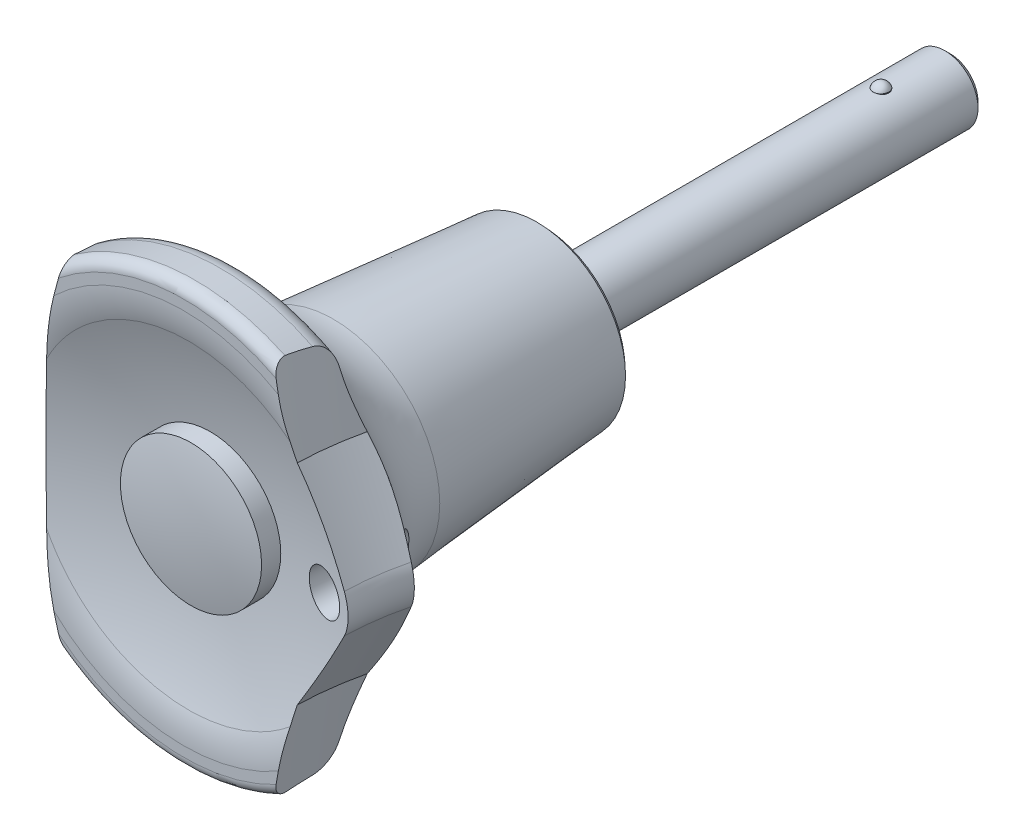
ISO-10303-21;
HEADER;
FILE_DESCRIPTION(('STEP AP214'),'2;1');
FILE_NAME('part.step','',(''),(''),'','','');
FILE_SCHEMA(('AUTOMOTIVE_DESIGN { 1 0 10303 214 1 1 1 1 }'));
ENDSEC;
DATA;
#1=APPLICATION_CONTEXT('core data for automotive mechanical design processes');
#2=APPLICATION_PROTOCOL_DEFINITION('international standard','automotive_design',2000,#1);
#3=PRODUCT_CONTEXT('',#1,'mechanical');
#4=PRODUCT('Part','Part','',(#3));
#5=PRODUCT_RELATED_PRODUCT_CATEGORY('part','',(#4));
#6=PRODUCT_DEFINITION_FORMATION('','',#4);
#7=PRODUCT_DEFINITION_CONTEXT('part definition',#1,'design');
#8=PRODUCT_DEFINITION('design','',#6,#7);
#9=PRODUCT_DEFINITION_SHAPE('','',#8);
#10=(LENGTH_UNIT() NAMED_UNIT(*) SI_UNIT(.MILLI.,.METRE.));
#11=(NAMED_UNIT(*) PLANE_ANGLE_UNIT() SI_UNIT($,.RADIAN.));
#12=(NAMED_UNIT(*) SI_UNIT($,.STERADIAN.) SOLID_ANGLE_UNIT());
#13=UNCERTAINTY_MEASURE_WITH_UNIT(LENGTH_MEASURE(1.E-05),#10,'distance_accuracy_value','');
#14=(GEOMETRIC_REPRESENTATION_CONTEXT(3) GLOBAL_UNCERTAINTY_ASSIGNED_CONTEXT((#13)) GLOBAL_UNIT_ASSIGNED_CONTEXT((#10,
#11,#12)) REPRESENTATION_CONTEXT('',''));
#15=CARTESIAN_POINT('',(0.,0.,0.));
#16=DIRECTION('',(0.,0.,1.));
#17=DIRECTION('',(1.,0.,0.));
#18=AXIS2_PLACEMENT_3D('',#15,#16,#17);
#19=CARTESIAN_POINT('',(0.,1.03504969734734E-13,0.667307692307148));
#20=DIRECTION('',(0.195307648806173,0.359806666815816,0.912356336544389));
#21=DIRECTION('',(-0.725322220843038,-0.573160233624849,0.381306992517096));
#22=AXIS2_PLACEMENT_3D('',#19,#20,#21);
#23=SPHERICAL_SURFACE('',#22,31.832692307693);
#24=CARTESIAN_POINT('',(0.,0.,31.85));
#25=DIRECTION('',(0.,0.,1.));
#26=DIRECTION('',(1.,0.,0.));
#27=AXIS2_PLACEMENT_3D('',#24,#25,#26);
#28=CIRCLE('',#27,6.4);
#29=CARTESIAN_POINT('',(6.4,0.,31.85));
#30=VERTEX_POINT('',#29);
#31=EDGE_CURVE('E652',#30,#30,#28,.F.);
#32=ORIENTED_EDGE('',*,*,#31,.F.);
#33=EDGE_LOOP('',(#32));
#34=FACE_BOUND('',#33,.T.);
#35=ADVANCED_FACE('F14',(#34),#23,.T.);
#36=CARTESIAN_POINT('',(0.,0.,24.05));
#37=DIRECTION('',(0.,0.,1.));
#38=DIRECTION('',(1.,0.,0.));
#39=AXIS2_PLACEMENT_3D('',#36,#37,#38);
#40=CYLINDRICAL_SURFACE('',#39,6.4);
#41=CARTESIAN_POINT('',(6.4,0.,30.1110590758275));
#42=CARTESIAN_POINT('',(6.40000129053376,-0.1798101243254,30.111059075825));
#43=CARTESIAN_POINT('',(6.39241914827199,-0.359599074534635,30.1110590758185));
#44=CARTESIAN_POINT('',(6.36214350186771,-0.717959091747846,30.1110590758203));
#45=CARTESIAN_POINT('',(6.33944602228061,-0.896529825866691,30.1110590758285));
#46=CARTESIAN_POINT('',(6.27906848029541,-1.25128110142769,30.1110590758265));
#47=CARTESIAN_POINT('',(6.24137507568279,-1.4274593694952,30.1110590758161));
#48=CARTESIAN_POINT('',(6.1512579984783,-1.77607703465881,30.1110590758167));
#49=CARTESIAN_POINT('',(6.09882894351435,-1.94851504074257,30.1110590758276));
#50=CARTESIAN_POINT('',(5.97966997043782,-2.288212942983,30.1110590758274));
#51=CARTESIAN_POINT('',(5.91295217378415,-2.45547709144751,30.1110590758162));
#52=CARTESIAN_POINT('',(5.76563661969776,-2.78385147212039,30.1110590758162));
#53=CARTESIAN_POINT('',(5.6850337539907,-2.94495941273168,30.1110590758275));
#54=CARTESIAN_POINT('',(5.51059240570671,-3.25971260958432,30.1110590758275));
#55=CARTESIAN_POINT('',(5.41676212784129,-3.41336241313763,30.1110590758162));
#56=CARTESIAN_POINT('',(5.21645805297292,-3.71226938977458,30.1110590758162));
#57=CARTESIAN_POINT('',(5.10997960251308,-3.85752344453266,30.1110590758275));
#58=CARTESIAN_POINT('',(4.88519374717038,-4.1385074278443,30.1110590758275));
#59=CARTESIAN_POINT('',(4.76688947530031,-4.27423986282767,30.1110590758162));
#60=CARTESIAN_POINT('',(4.51922341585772,-4.53530651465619,30.1110590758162));
#61=CARTESIAN_POINT('',(4.38985756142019,-4.66063687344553,30.1110590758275));
#62=CARTESIAN_POINT('',(4.12107041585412,-4.89991253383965,30.1110590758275));
#63=CARTESIAN_POINT('',(3.98165245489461,-5.01386157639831,30.1110590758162));
#64=CARTESIAN_POINT('',(3.69366097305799,-5.22965167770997,30.1110590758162));
#65=CARTESIAN_POINT('',(3.54508409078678,-5.33148825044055,30.1110590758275));
#66=CARTESIAN_POINT('',(3.23993719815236,-5.52224318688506,30.1110590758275));
#67=CARTESIAN_POINT('',(3.08337030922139,-5.61116654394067,30.1110590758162));
#68=CARTESIAN_POINT('',(2.76324420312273,-5.77554056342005,30.1110590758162));
#69=CARTESIAN_POINT('',(2.59968242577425,-5.85098623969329,30.1110590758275));
#70=CARTESIAN_POINT('',(2.26684452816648,-5.98780235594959,30.1110590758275));
#71=CARTESIAN_POINT('',(2.09757055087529,-6.04917800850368,30.1110590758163));
#72=CARTESIAN_POINT('',(1.75439473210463,-6.15747441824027,30.1110590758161));
#73=CARTESIAN_POINT('',(1.58049120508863,-6.20438983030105,30.1110590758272));
#74=CARTESIAN_POINT('',(1.22940084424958,-6.28338445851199,30.1110590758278));
#75=CARTESIAN_POINT('',(1.05221523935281,-6.31546911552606,30.1110590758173));
#76=CARTESIAN_POINT('',(0.695754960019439,-6.36461764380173,30.111059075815));
#77=CARTESIAN_POINT('',(0.516479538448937,-6.38167596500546,30.1110590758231));
#78=CARTESIAN_POINT('',(-0.0224375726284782,-6.41003711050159,30.1110590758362));
#79=CARTESIAN_POINT('',(-0.383552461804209,-6.39861178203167,30.1110590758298));
#80=CARTESIAN_POINT('',(-1.09854136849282,-6.31529390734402,30.1110590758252));
#81=CARTESIAN_POINT('',(-1.45241538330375,-6.24340133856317,30.1110590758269));
#82=CARTESIAN_POINT('',(-2.14312422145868,-6.04122706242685,30.1110590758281));
#83=CARTESIAN_POINT('',(-2.47995902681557,-5.91094529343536,30.1110590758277));
#84=CARTESIAN_POINT('',(-3.12696102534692,-5.59568095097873,30.1110590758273));
#85=CARTESIAN_POINT('',(-3.43712822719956,-5.41069839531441,30.1110590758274));
#86=CARTESIAN_POINT('',(-4.02200801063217,-4.99128634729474,30.1110590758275));
#87=CARTESIAN_POINT('',(-4.29672060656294,-4.75685687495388,30.1110590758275));
#88=CARTESIAN_POINT('',(-4.80288833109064,-4.2452049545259,30.1110590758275));
#89=CARTESIAN_POINT('',(-5.0343434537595,-3.96798250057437,30.1110590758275));
#90=CARTESIAN_POINT('',(-5.44742715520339,-3.3786143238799,30.1110590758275));
#91=CARTESIAN_POINT('',(-5.62905572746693,-3.06646859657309,30.1110590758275));
#92=CARTESIAN_POINT('',(-5.93733003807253,-2.41611476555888,30.1110590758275));
#93=CARTESIAN_POINT('',(-6.06397577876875,-2.07790666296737,30.1110590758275));
#94=CARTESIAN_POINT('',(-6.25868942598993,-1.38502883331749,30.1110590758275));
#95=CARTESIAN_POINT('',(-6.32675733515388,-1.03035910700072,30.1110590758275));
#96=CARTESIAN_POINT('',(-6.40238305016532,-0.314626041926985,30.1110590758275));
#97=CARTESIAN_POINT('',(-6.4099408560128,0.0464372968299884,30.1110590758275));
#98=CARTESIAN_POINT('',(-6.36433185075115,0.764708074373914,30.1110590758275));
#99=CARTESIAN_POINT('',(-6.31116503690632,1.12191551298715,30.1110590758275));
#100=CARTESIAN_POINT('',(-6.14561593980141,1.82233442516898,30.1110590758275));
#101=CARTESIAN_POINT('',(-6.03323365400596,2.16554589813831,30.1110590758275));
#102=CARTESIAN_POINT('',(-5.75244417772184,2.82823003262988,30.1110590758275));
#103=CARTESIAN_POINT('',(-5.58403699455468,3.14770269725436,30.1110590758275));
#104=CARTESIAN_POINT('',(-5.1959770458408,3.75384041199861,30.1110590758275));
#105=CARTESIAN_POINT('',(-4.97632428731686,4.04050546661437,30.1110590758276));
#106=CARTESIAN_POINT('',(-4.49201316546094,4.57289025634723,30.1110590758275));
#107=CARTESIAN_POINT('',(-4.22735478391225,4.81860997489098,30.1110590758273));
#108=CARTESIAN_POINT('',(-3.66052736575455,5.26212983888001,30.1110590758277));
#109=CARTESIAN_POINT('',(-3.35835831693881,5.45992996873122,30.1110590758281));
#110=CARTESIAN_POINT('',(-2.72515445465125,5.80199137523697,30.1110590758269));
#111=CARTESIAN_POINT('',(-2.39411967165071,5.94625270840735,30.1110590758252));
#112=CARTESIAN_POINT('',(-1.71233203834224,6.17715664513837,30.1110590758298));
#113=CARTESIAN_POINT('',(-1.3615791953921,6.26379927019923,30.1110590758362));
#114=CARTESIAN_POINT('',(-0.828635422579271,6.34869298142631,30.1110590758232));
#115=CARTESIAN_POINT('',(-0.649753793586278,6.36947821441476,30.1110590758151));
#116=CARTESIAN_POINT('',(-0.290893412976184,6.3959118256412,30.1110590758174));
#117=CARTESIAN_POINT('',(-0.110915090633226,6.40156578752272,30.1110590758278));
#118=CARTESIAN_POINT('',(0.248931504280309,6.39769010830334,30.1110590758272));
#119=CARTESIAN_POINT('',(0.428799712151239,6.38815488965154,30.1110590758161));
#120=CARTESIAN_POINT('',(0.787030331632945,6.35397041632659,30.1110590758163));
#121=CARTESIAN_POINT('',(0.965393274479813,6.32932674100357,30.1110590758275));
#122=CARTESIAN_POINT('',(1.31947460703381,6.26509181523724,30.1110590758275));
#123=CARTESIAN_POINT('',(1.49519199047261,6.22549501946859,30.1110590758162));
#124=CARTESIAN_POINT('',(1.84260157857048,6.13165408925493,30.1110590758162));
#125=CARTESIAN_POINT('',(2.01429524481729,6.07741536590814,30.1110590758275));
#126=CARTESIAN_POINT('',(2.35256975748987,5.95464555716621,30.1110590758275));
#127=CARTESIAN_POINT('',(2.51914859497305,5.88610893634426,30.1110590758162));
#128=CARTESIAN_POINT('',(2.84587864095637,5.73527147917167,30.1110590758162));
#129=CARTESIAN_POINT('',(3.00603219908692,5.65297573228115,30.1110590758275));
#130=CARTESIAN_POINT('',(3.31889024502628,5.4751578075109,30.1110590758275));
#131=CARTESIAN_POINT('',(3.47159225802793,5.37963127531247,30.1110590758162));
#132=CARTESIAN_POINT('',(3.76834973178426,5.17608944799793,30.1110590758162));
#133=CARTESIAN_POINT('',(3.91240836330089,5.06807877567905,30.1110590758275));
#134=CARTESIAN_POINT('',(4.19095341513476,4.84027769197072,30.1110590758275));
#135=CARTESIAN_POINT('',(4.32543729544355,4.72048417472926,30.1110590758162));
#136=CARTESIAN_POINT('',(4.58378691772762,4.47003941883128,30.1110590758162));
#137=CARTESIAN_POINT('',(4.70765655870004,4.33939220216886,30.1110590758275));
#138=CARTESIAN_POINT('',(4.94402627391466,4.06804608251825,30.1110590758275));
#139=CARTESIAN_POINT('',(5.05651927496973,3.92734101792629,30.1110590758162));
#140=CARTESIAN_POINT('',(5.26920889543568,3.6370054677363,30.1110590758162));
#141=CARTESIAN_POINT('',(5.36941003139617,3.48737829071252,30.1110590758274));
#142=CARTESIAN_POINT('',(5.55693134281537,3.18008480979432,30.1110590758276));
#143=CARTESIAN_POINT('',(5.64424055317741,3.02241181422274,30.1110590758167));
#144=CARTESIAN_POINT('',(5.80522542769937,2.70032605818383,30.1110590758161));
#145=CARTESIAN_POINT('',(5.8789060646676,2.53591578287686,30.1110590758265));
#146=CARTESIAN_POINT('',(6.01208998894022,2.2016165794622,30.1110590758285));
#147=CARTESIAN_POINT('',(6.07160584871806,2.0317326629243,30.1110590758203));
#148=CARTESIAN_POINT('',(6.17610679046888,1.68761339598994,30.1110590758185));
#149=CARTESIAN_POINT('',(6.22109569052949,1.51337920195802,30.111059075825));
#150=CARTESIAN_POINT('',(6.30560169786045,1.11794110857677,30.1110590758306));
#151=CARTESIAN_POINT('',(6.34097102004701,0.89583866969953,30.1110590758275));
#152=CARTESIAN_POINT('',(6.38816936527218,0.449146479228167,30.1110590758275));
#153=CARTESIAN_POINT('',(6.39999838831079,0.224556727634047,30.1110590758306));
#154=CARTESIAN_POINT('',(6.4,0.,30.1110590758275));
#155=B_SPLINE_CURVE_WITH_KNOTS('',3,(#41,#42,#43,#44,#45,#46,#47,#48,#49,#50,#51,#52,#53,#54,
#55,#56,#57,#58,#59,#60,#61,#62,#63,#64,#65,#66,#67,#68,#69,#70,#71,#72,#73,#74,#75,#76,#77,#78,
#79,#80,#81,#82,#83,#84,#85,#86,#87,#88,#89,#90,#91,#92,#93,#94,#95,#96,#97,#98,#99,#100,#101,
#102,#103,#104,#105,#106,#107,#108,#109,#110,#111,#112,#113,#114,#115,#116,#117,#118,#119,#120,
#121,#122,#123,#124,#125,#126,#127,#128,#129,#130,#131,#132,#133,#134,#135,#136,#137,#138,#139,
#140,#141,#142,#143,#144,#145,#146,#147,#148,#149,#150,#151,#152,#153,#154),.UNSPECIFIED.,.T.,
.F.,(4,2,2,2,2,2,2,2,2,2,2,2,2,2,2,2,2,2,2,2,2,2,2,2,2,2,2,2,2,2,2,2,2,2,2,2,2,2,2,2,2,2,2,2,2,
2,2,2,2,2,2,2,2,2,2,2,4),(0.,0.539234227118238,1.07861033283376,1.61846741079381,
2.15852193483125,2.69812012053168,3.23791724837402,3.7773810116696,4.31704387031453,
4.85656413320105,5.39628361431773,5.93582510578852,6.47556580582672,7.01509723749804,
7.55482786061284,8.09435820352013,8.63408774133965,9.17361911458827,9.71334968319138,
10.7916501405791,11.869951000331,12.9482529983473,14.0265546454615,15.1048558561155,
16.1831572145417,17.2614587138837,18.339760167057,19.4180615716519,20.4963629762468,
21.5746644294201,22.6529659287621,23.7312672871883,24.8095684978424,25.8878701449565,
26.9661721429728,28.0444730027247,29.1227734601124,29.6625040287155,30.2020354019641,
30.7417649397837,31.281295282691,31.8210259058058,32.3605573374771,32.9002980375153,
33.4398395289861,33.9795590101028,34.5190792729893,35.0587421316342,35.5982058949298,
36.1380030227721,36.6776012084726,37.21765573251,37.75751281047,38.2968889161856,
38.8361231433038,39.5095483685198,40.1829735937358),.UNSPECIFIED.);
#156=CARTESIAN_POINT('',(6.4,0.,30.1110590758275));
#157=VERTEX_POINT('',#156);
#158=EDGE_CURVE('E656',#157,#157,#155,.T.);
#159=ORIENTED_EDGE('',*,*,#158,.F.);
#160=EDGE_LOOP('',(#159));
#161=FACE_BOUND('',#160,.T.);
#162=ORIENTED_EDGE('',*,*,#31,.T.);
#163=EDGE_LOOP('',(#162));
#164=FACE_BOUND('',#163,.T.);
#165=ADVANCED_FACE('F613',(#161,#164),#40,.T.);
#166=CARTESIAN_POINT('',(0.,2.76,-30.7));
#167=DIRECTION('',(0.514842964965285,0.0169099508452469,0.85711771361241));
#168=DIRECTION('',(0.631593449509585,0.668565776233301,-0.392567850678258));
#169=AXIS2_PLACEMENT_3D('',#166,#167,#168);
#170=SPHERICAL_SURFACE('',#169,0.74);
#171=CARTESIAN_POINT('',(0.,2.99999999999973,-30.7));
#172=DIRECTION('',(0.,1.,0.));
#173=DIRECTION('',(0.,0.,1.));
#174=AXIS2_PLACEMENT_3D('',#171,#172,#173);
#175=CIRCLE('',#174,0.7);
#176=CARTESIAN_POINT('',(0.,2.99999999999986,-30.));
#177=VERTEX_POINT('',#176);
#178=CARTESIAN_POINT('',(0.,2.99999999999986,-31.4));
#179=VERTEX_POINT('',#178);
#180=EDGE_CURVE('E599',#177,#179,#175,.F.);
#181=ORIENTED_EDGE('',*,*,#180,.F.);
#182=CARTESIAN_POINT('',(0.,3.,-30.7));
#183=DIRECTION('',(0.,1.,0.));
#184=DIRECTION('',(0.,0.,1.));
#185=AXIS2_PLACEMENT_3D('',#182,#183,#184);
#186=CIRCLE('',#185,0.7);
#187=EDGE_CURVE('E533',#177,#179,#186,.T.);
#188=ORIENTED_EDGE('',*,*,#187,.T.);
#189=EDGE_LOOP('',(#181,#188));
#190=FACE_BOUND('',#189,.T.);
#191=ADVANCED_FACE('F609',(#190),#170,.T.);
#192=CARTESIAN_POINT('',(0.,-2.76,-30.7));
#193=DIRECTION('',(0.514842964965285,0.0169099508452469,0.85711771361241));
#194=DIRECTION('',(0.631593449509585,0.668565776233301,-0.392567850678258));
#195=AXIS2_PLACEMENT_3D('',#192,#193,#194);
#196=SPHERICAL_SURFACE('',#195,0.74);
#197=CARTESIAN_POINT('',(0.,-3.,-30.7));
#198=DIRECTION('',(0.,1.,0.));
#199=DIRECTION('',(0.,0.,1.));
#200=AXIS2_PLACEMENT_3D('',#197,#198,#199);
#201=CIRCLE('',#200,0.7);
#202=CARTESIAN_POINT('',(0.,-3.00000000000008,-31.4));
#203=VERTEX_POINT('',#202);
#204=CARTESIAN_POINT('',(0.,-3.00000000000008,-30.));
#205=VERTEX_POINT('',#204);
#206=EDGE_CURVE('E549',#203,#205,#201,.T.);
#207=ORIENTED_EDGE('',*,*,#206,.F.);
#208=CARTESIAN_POINT('',(0.,-3.00000000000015,-30.7));
#209=DIRECTION('',(0.,1.,0.));
#210=DIRECTION('',(0.,0.,1.));
#211=AXIS2_PLACEMENT_3D('',#208,#209,#210);
#212=CIRCLE('',#211,0.7);
#213=EDGE_CURVE('E530',#205,#203,#212,.T.);
#214=ORIENTED_EDGE('',*,*,#213,.F.);
#215=EDGE_LOOP('',(#207,#214));
#216=FACE_BOUND('',#215,.T.);
#217=ADVANCED_FACE('F612',(#216),#196,.T.);
#218=CARTESIAN_POINT('',(0.,1.25,-37.));
#219=DIRECTION('',(0.,0.,-1.));
#220=DIRECTION('',(-1.,0.,0.));
#221=AXIS2_PLACEMENT_3D('',#218,#219,#220);
#222=PLANE('',#221);
#223=CARTESIAN_POINT('',(0.,0.,-37.0000000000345));
#224=DIRECTION('',(0.,0.,1.));
#225=DIRECTION('',(1.,0.,0.));
#226=AXIS2_PLACEMENT_3D('',#223,#224,#225);
#227=CIRCLE('',#226,2.49999999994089);
#228=CARTESIAN_POINT('',(2.49999999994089,0.,-37.0000000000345));
#229=VERTEX_POINT('',#228);
#230=EDGE_CURVE('E541',#229,#229,#227,.T.);
#231=ORIENTED_EDGE('',*,*,#230,.F.);
#232=EDGE_LOOP('',(#231));
#233=FACE_BOUND('',#232,.T.);
#234=ADVANCED_FACE('F318',(#233),#222,.T.);
#235=CARTESIAN_POINT('',(0.,0.,-30.7));
#236=DIRECTION('',(0.,1.,0.));
#237=DIRECTION('',(0.,0.,1.));
#238=AXIS2_PLACEMENT_3D('',#235,#236,#237);
#239=CYLINDRICAL_SURFACE('',#238,0.7);
#240=CARTESIAN_POINT('',(0.,3.,-31.4));
#241=CARTESIAN_POINT('',(0.0388250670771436,3.00002806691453,-31.4000358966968));
#242=CARTESIAN_POINT('',(0.0776289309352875,2.99924718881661,-31.396772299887));
#243=CARTESIAN_POINT('',(0.154051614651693,2.99627816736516,-31.3839246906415));
#244=CARTESIAN_POINT('',(0.191672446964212,2.99409256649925,-31.3743520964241));
#245=CARTESIAN_POINT('',(0.264735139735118,2.98852325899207,-31.3491629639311));
#246=CARTESIAN_POINT('',(0.300176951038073,2.98513952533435,-31.3335462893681));
#247=CARTESIAN_POINT('',(0.367944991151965,2.97754553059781,-31.296743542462));
#248=CARTESIAN_POINT('',(0.400270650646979,2.97333511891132,-31.275556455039));
#249=CARTESIAN_POINT('',(0.4614618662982,2.96446054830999,-31.2278099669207));
#250=CARTESIAN_POINT('',(0.490263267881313,2.95979017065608,-31.2011694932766));
#251=CARTESIAN_POINT('',(0.543034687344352,2.9505647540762,-31.1434443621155));
#252=CARTESIAN_POINT('',(0.567003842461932,2.94600973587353,-31.112358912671));
#253=CARTESIAN_POINT('',(0.609720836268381,2.9374687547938,-31.0461391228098));
#254=CARTESIAN_POINT('',(0.628398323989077,2.93349077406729,-31.0109582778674));
#255=CARTESIAN_POINT('',(0.6595491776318,2.92664499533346,-30.9378506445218));
#256=CARTESIAN_POINT('',(0.672023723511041,2.92377698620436,-30.8999243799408));
#257=CARTESIAN_POINT('',(0.690199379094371,2.91953955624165,-30.8231061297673));
#258=CARTESIAN_POINT('',(0.696015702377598,2.91814467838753,-30.7842428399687));
#259=CARTESIAN_POINT('',(0.701068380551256,2.91693510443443,-30.7060680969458));
#260=CARTESIAN_POINT('',(0.700305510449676,2.91712022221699,-30.6667566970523));
#261=CARTESIAN_POINT('',(0.692313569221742,2.91902680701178,-30.5896718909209));
#262=CARTESIAN_POINT('',(0.685220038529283,2.9207160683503,-30.5518835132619));
#263=CARTESIAN_POINT('',(0.664983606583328,2.92538948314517,-30.4780487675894));
#264=CARTESIAN_POINT('',(0.651840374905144,2.92837370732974,-30.4420024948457));
#265=CARTESIAN_POINT('',(0.619757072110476,2.93533159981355,-30.3723012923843));
#266=CARTESIAN_POINT('',(0.60076613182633,2.93931389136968,-30.3386706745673));
#267=CARTESIAN_POINT('',(0.557562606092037,2.94781397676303,-30.2750249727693));
#268=CARTESIAN_POINT('',(0.533349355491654,2.95233183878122,-30.2450103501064));
#269=CARTESIAN_POINT('',(0.479681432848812,2.96153060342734,-30.1886721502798));
#270=CARTESIAN_POINT('',(0.450112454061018,2.96621278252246,-30.1624575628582));
#271=CARTESIAN_POINT('',(0.386934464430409,2.97511303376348,-30.1153336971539));
#272=CARTESIAN_POINT('',(0.35332440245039,2.97933098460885,-30.0944258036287));
#273=CARTESIAN_POINT('',(0.28287017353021,2.9868450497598,-30.0584749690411));
#274=CARTESIAN_POINT('',(0.246015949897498,2.99013815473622,-30.0434511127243));
#275=CARTESIAN_POINT('',(0.170234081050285,2.99540575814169,-30.0198604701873));
#276=CARTESIAN_POINT('',(0.131309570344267,2.99738219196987,-30.0112842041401));
#277=CARTESIAN_POINT('',(0.0767145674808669,2.99905826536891,-30.0040453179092));
#278=CARTESIAN_POINT('',(0.0613998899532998,2.99941099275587,-30.0025279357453));
#279=CARTESIAN_POINT('',(0.0307258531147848,2.99988170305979,-30.0005064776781));
#280=CARTESIAN_POINT('',(0.0153666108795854,3.00000007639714,-30.000000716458));
#281=CARTESIAN_POINT('',(0.,3.,-30.));
#282=B_SPLINE_CURVE_WITH_KNOTS('',3,(#240,#241,#242,#243,#244,#245,#246,#247,#248,#249,#250,
#251,#252,#253,#254,#255,#256,#257,#258,#259,#260,#261,#262,#263,#264,#265,#266,#267,#268,#269,
#270,#271,#272,#273,#274,#275,#276,#277,#278,#279,#280,#281),.UNSPECIFIED.,.F.,.F.,(4,2,2,2,2,2,
2,2,2,2,2,2,2,2,2,2,2,2,2,2,4),(0.,0.116298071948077,0.232386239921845,0.348477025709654,
0.464588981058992,0.582572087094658,0.700576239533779,0.820082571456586,0.93956616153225,
1.05694938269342,1.17431877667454,1.28923400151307,1.40415550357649,1.52010638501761,
1.63607204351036,1.75489104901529,1.8737410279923,1.99297336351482,2.11203004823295,
2.15818339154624,2.20425978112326),.UNSPECIFIED.);
#283=EDGE_CURVE('E552',#179,#177,#282,.T.);
#284=ORIENTED_EDGE('',*,*,#283,.F.);
#285=ORIENTED_EDGE('',*,*,#187,.F.);
#286=EDGE_LOOP('',(#284,#285));
#287=FACE_BOUND('',#286,.T.);
#288=ADVANCED_FACE('F568',(#287),#239,.T.);
#289=CARTESIAN_POINT('',(0.,0.,-30.7));
#290=DIRECTION('',(0.,1.,0.));
#291=DIRECTION('',(0.,0.,1.));
#292=AXIS2_PLACEMENT_3D('',#289,#290,#291);
#293=CYLINDRICAL_SURFACE('',#292,0.7);
#294=CARTESIAN_POINT('',(0.,2.99999999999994,-30.));
#295=CARTESIAN_POINT('',(-0.0388250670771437,3.0000280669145,-29.9999641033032));
#296=CARTESIAN_POINT('',(-0.0776289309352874,2.9992471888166,-30.003227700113));
#297=CARTESIAN_POINT('',(-0.154051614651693,2.99627816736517,-30.0160753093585));
#298=CARTESIAN_POINT('',(-0.191672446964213,2.99409256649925,-30.0256479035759));
#299=CARTESIAN_POINT('',(-0.264735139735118,2.98852325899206,-30.0508370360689));
#300=CARTESIAN_POINT('',(-0.300176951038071,2.98513952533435,-30.0664537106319));
#301=CARTESIAN_POINT('',(-0.367944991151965,2.97754553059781,-30.103256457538));
#302=CARTESIAN_POINT('',(-0.400270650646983,2.97333511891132,-30.124443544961));
#303=CARTESIAN_POINT('',(-0.461461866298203,2.96446054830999,-30.1721900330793));
#304=CARTESIAN_POINT('',(-0.490263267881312,2.95979017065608,-30.1988305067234));
#305=CARTESIAN_POINT('',(-0.54303468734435,2.9505647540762,-30.2565556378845));
#306=CARTESIAN_POINT('',(-0.567003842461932,2.94600973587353,-30.287641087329));
#307=CARTESIAN_POINT('',(-0.609720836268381,2.9374687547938,-30.3538608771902));
#308=CARTESIAN_POINT('',(-0.628398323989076,2.93349077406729,-30.3890417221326));
#309=CARTESIAN_POINT('',(-0.659549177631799,2.92664499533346,-30.4621493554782));
#310=CARTESIAN_POINT('',(-0.67202372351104,2.92377698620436,-30.5000756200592));
#311=CARTESIAN_POINT('',(-0.690199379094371,2.91953955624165,-30.5768938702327));
#312=CARTESIAN_POINT('',(-0.696015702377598,2.91814467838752,-30.6157571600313));
#313=CARTESIAN_POINT('',(-0.701068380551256,2.91693510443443,-30.6939319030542));
#314=CARTESIAN_POINT('',(-0.700305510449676,2.91712022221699,-30.7332433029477));
#315=CARTESIAN_POINT('',(-0.692313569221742,2.91902680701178,-30.8103281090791));
#316=CARTESIAN_POINT('',(-0.685220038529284,2.9207160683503,-30.8481164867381));
#317=CARTESIAN_POINT('',(-0.664983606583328,2.92538948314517,-30.9219512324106));
#318=CARTESIAN_POINT('',(-0.651840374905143,2.92837370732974,-30.9579975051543));
#319=CARTESIAN_POINT('',(-0.619757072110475,2.93533159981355,-31.0276987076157));
#320=CARTESIAN_POINT('',(-0.60076613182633,2.93931389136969,-31.0613293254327));
#321=CARTESIAN_POINT('',(-0.557562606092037,2.94781397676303,-31.1249750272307));
#322=CARTESIAN_POINT('',(-0.533349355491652,2.95233183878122,-31.1549896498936));
#323=CARTESIAN_POINT('',(-0.479681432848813,2.96153060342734,-31.2113278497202));
#324=CARTESIAN_POINT('',(-0.450112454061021,2.96621278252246,-31.2375424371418));
#325=CARTESIAN_POINT('',(-0.386934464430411,2.97511303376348,-31.2846663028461));
#326=CARTESIAN_POINT('',(-0.35332440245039,2.97933098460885,-31.3055741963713));
#327=CARTESIAN_POINT('',(-0.282870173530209,2.9868450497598,-31.3415250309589));
#328=CARTESIAN_POINT('',(-0.246015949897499,2.99013815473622,-31.3565488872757));
#329=CARTESIAN_POINT('',(-0.170234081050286,2.99540575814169,-31.3801395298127));
#330=CARTESIAN_POINT('',(-0.131309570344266,2.99738219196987,-31.3887157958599));
#331=CARTESIAN_POINT('',(-0.0767145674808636,2.99905826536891,-31.3959546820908));
#332=CARTESIAN_POINT('',(-0.0613998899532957,2.99941099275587,-31.3974720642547));
#333=CARTESIAN_POINT('',(-0.0307258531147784,2.99988170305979,-31.3994935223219));
#334=CARTESIAN_POINT('',(-0.0153666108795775,3.00000007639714,-31.399999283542));
#335=CARTESIAN_POINT('',(0.,3.,-31.4));
#336=B_SPLINE_CURVE_WITH_KNOTS('',3,(#294,#295,#296,#297,#298,#299,#300,#301,#302,#303,#304,
#305,#306,#307,#308,#309,#310,#311,#312,#313,#314,#315,#316,#317,#318,#319,#320,#321,#322,#323,
#324,#325,#326,#327,#328,#329,#330,#331,#332,#333,#334,#335),.UNSPECIFIED.,.F.,.F.,(4,2,2,2,2,2,
2,2,2,2,2,2,2,2,2,2,2,2,2,2,4),(0.,0.116298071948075,0.232386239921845,0.348477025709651,
0.464588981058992,0.582572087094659,0.700576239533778,0.820082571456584,0.939566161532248,
1.05694938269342,1.17431877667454,1.28923400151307,1.40415550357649,1.52010638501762,
1.63607204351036,1.75489104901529,1.87374102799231,1.99297336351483,2.11203004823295,
2.15818339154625,2.20425978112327),.UNSPECIFIED.);
#337=EDGE_CURVE('E584',#177,#179,#336,.T.);
#338=ORIENTED_EDGE('',*,*,#337,.F.);
#339=ORIENTED_EDGE('',*,*,#180,.T.);
#340=EDGE_LOOP('',(#338,#339));
#341=FACE_BOUND('',#340,.T.);
#342=ADVANCED_FACE('F578',(#341),#293,.T.);
#343=CARTESIAN_POINT('',(0.,0.,-30.7));
#344=DIRECTION('',(0.,1.,0.));
#345=DIRECTION('',(0.,0.,1.));
#346=AXIS2_PLACEMENT_3D('',#343,#344,#345);
#347=CYLINDRICAL_SURFACE('',#346,0.7);
#348=CARTESIAN_POINT('',(0.,-3.,-31.4));
#349=CARTESIAN_POINT('',(-0.0388250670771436,-3.00002806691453,-31.4000358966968));
#350=CARTESIAN_POINT('',(-0.0776289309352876,-2.99924718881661,-31.396772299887));
#351=CARTESIAN_POINT('',(-0.154051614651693,-2.99627816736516,-31.3839246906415));
#352=CARTESIAN_POINT('',(-0.191672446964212,-2.99409256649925,-31.3743520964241));
#353=CARTESIAN_POINT('',(-0.264735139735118,-2.98852325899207,-31.3491629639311));
#354=CARTESIAN_POINT('',(-0.300176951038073,-2.98513952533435,-31.3335462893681));
#355=CARTESIAN_POINT('',(-0.367944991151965,-2.97754553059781,-31.296743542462));
#356=CARTESIAN_POINT('',(-0.400270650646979,-2.97333511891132,-31.275556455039));
#357=CARTESIAN_POINT('',(-0.4614618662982,-2.96446054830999,-31.2278099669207));
#358=CARTESIAN_POINT('',(-0.490263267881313,-2.95979017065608,-31.2011694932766));
#359=CARTESIAN_POINT('',(-0.543034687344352,-2.9505647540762,-31.1434443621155));
#360=CARTESIAN_POINT('',(-0.567003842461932,-2.94600973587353,-31.112358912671));
#361=CARTESIAN_POINT('',(-0.609720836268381,-2.9374687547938,-31.0461391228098));
#362=CARTESIAN_POINT('',(-0.628398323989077,-2.93349077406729,-31.0109582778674));
#363=CARTESIAN_POINT('',(-0.6595491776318,-2.92664499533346,-30.9378506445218));
#364=CARTESIAN_POINT('',(-0.672023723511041,-2.92377698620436,-30.8999243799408));
#365=CARTESIAN_POINT('',(-0.690199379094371,-2.91953955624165,-30.8231061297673));
#366=CARTESIAN_POINT('',(-0.696015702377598,-2.91814467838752,-30.7842428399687));
#367=CARTESIAN_POINT('',(-0.701068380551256,-2.91693510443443,-30.7060680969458));
#368=CARTESIAN_POINT('',(-0.700305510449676,-2.91712022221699,-30.6667566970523));
#369=CARTESIAN_POINT('',(-0.692313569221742,-2.91902680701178,-30.5896718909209));
#370=CARTESIAN_POINT('',(-0.685220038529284,-2.9207160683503,-30.5518835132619));
#371=CARTESIAN_POINT('',(-0.664983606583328,-2.92538948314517,-30.4780487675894));
#372=CARTESIAN_POINT('',(-0.651840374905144,-2.92837370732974,-30.4420024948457));
#373=CARTESIAN_POINT('',(-0.619757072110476,-2.93533159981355,-30.3723012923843));
#374=CARTESIAN_POINT('',(-0.600766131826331,-2.93931389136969,-30.3386706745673));
#375=CARTESIAN_POINT('',(-0.557562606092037,-2.94781397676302,-30.2750249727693));
#376=CARTESIAN_POINT('',(-0.533349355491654,-2.95233183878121,-30.2450103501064));
#377=CARTESIAN_POINT('',(-0.479681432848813,-2.96153060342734,-30.1886721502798));
#378=CARTESIAN_POINT('',(-0.450112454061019,-2.96621278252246,-30.1624575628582));
#379=CARTESIAN_POINT('',(-0.38693446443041,-2.97511303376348,-30.1153336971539));
#380=CARTESIAN_POINT('',(-0.35332440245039,-2.97933098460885,-30.0944258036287));
#381=CARTESIAN_POINT('',(-0.28287017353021,-2.9868450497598,-30.0584749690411));
#382=CARTESIAN_POINT('',(-0.246015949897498,-2.99013815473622,-30.0434511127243));
#383=CARTESIAN_POINT('',(-0.170234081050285,-2.99540575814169,-30.0198604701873));
#384=CARTESIAN_POINT('',(-0.131309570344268,-2.99738219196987,-30.0112842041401));
#385=CARTESIAN_POINT('',(-0.0767145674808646,-2.99905826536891,-30.0040453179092));
#386=CARTESIAN_POINT('',(-0.0613998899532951,-2.99941099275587,-30.0025279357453));
#387=CARTESIAN_POINT('',(-0.0307258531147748,-2.99988170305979,-30.0005064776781));
#388=CARTESIAN_POINT('',(-0.0153666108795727,-3.00000007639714,-30.000000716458));
#389=CARTESIAN_POINT('',(0.,-3.,-30.));
#390=B_SPLINE_CURVE_WITH_KNOTS('',3,(#348,#349,#350,#351,#352,#353,#354,#355,#356,#357,#358,
#359,#360,#361,#362,#363,#364,#365,#366,#367,#368,#369,#370,#371,#372,#373,#374,#375,#376,#377,
#378,#379,#380,#381,#382,#383,#384,#385,#386,#387,#388,#389),.UNSPECIFIED.,.F.,.F.,(4,2,2,2,2,2,
2,2,2,2,2,2,2,2,2,2,2,2,2,2,4),(0.,0.116298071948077,0.232386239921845,0.348477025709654,
0.464588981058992,0.582572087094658,0.700576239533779,0.820082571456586,0.939566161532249,
1.05694938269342,1.17431877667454,1.28923400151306,1.40415550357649,1.52010638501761,
1.63607204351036,1.75489104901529,1.87374102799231,1.99297336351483,2.11203004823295,
2.15818339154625,2.20425978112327),.UNSPECIFIED.);
#391=EDGE_CURVE('E592',#203,#205,#390,.T.);
#392=ORIENTED_EDGE('',*,*,#391,.F.);
#393=ORIENTED_EDGE('',*,*,#206,.T.);
#394=EDGE_LOOP('',(#392,#393));
#395=FACE_BOUND('',#394,.T.);
#396=ADVANCED_FACE('F600',(#395),#347,.T.);
#397=CARTESIAN_POINT('',(0.,0.,-30.7));
#398=DIRECTION('',(0.,1.,0.));
#399=DIRECTION('',(0.,0.,1.));
#400=AXIS2_PLACEMENT_3D('',#397,#398,#399);
#401=CYLINDRICAL_SURFACE('',#400,0.7);
#402=CARTESIAN_POINT('',(0.,-3.00000000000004,-30.));
#403=CARTESIAN_POINT('',(0.0388250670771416,-3.00002806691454,-29.9999641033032));
#404=CARTESIAN_POINT('',(0.0776289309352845,-2.99924718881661,-30.003227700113));
#405=CARTESIAN_POINT('',(0.154051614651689,-2.99627816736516,-30.0160753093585));
#406=CARTESIAN_POINT('',(0.19167244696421,-2.99409256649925,-30.0256479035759));
#407=CARTESIAN_POINT('',(0.264735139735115,-2.98852325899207,-30.0508370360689));
#408=CARTESIAN_POINT('',(0.300176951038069,-2.98513952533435,-30.0664537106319));
#409=CARTESIAN_POINT('',(0.367944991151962,-2.97754553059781,-30.103256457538));
#410=CARTESIAN_POINT('',(0.400270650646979,-2.97333511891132,-30.124443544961));
#411=CARTESIAN_POINT('',(0.461461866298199,-2.96446054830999,-30.1721900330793));
#412=CARTESIAN_POINT('',(0.490263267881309,-2.95979017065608,-30.1988305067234));
#413=CARTESIAN_POINT('',(0.543034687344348,-2.9505647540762,-30.2565556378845));
#414=CARTESIAN_POINT('',(0.56700384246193,-2.94600973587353,-30.287641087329));
#415=CARTESIAN_POINT('',(0.60972083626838,-2.9374687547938,-30.3538608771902));
#416=CARTESIAN_POINT('',(0.628398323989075,-2.93349077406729,-30.3890417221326));
#417=CARTESIAN_POINT('',(0.659549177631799,-2.92664499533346,-30.4621493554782));
#418=CARTESIAN_POINT('',(0.67202372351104,-2.92377698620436,-30.5000756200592));
#419=CARTESIAN_POINT('',(0.69019937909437,-2.91953955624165,-30.5768938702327));
#420=CARTESIAN_POINT('',(0.696015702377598,-2.91814467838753,-30.6157571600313));
#421=CARTESIAN_POINT('',(0.701068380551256,-2.91693510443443,-30.6939319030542));
#422=CARTESIAN_POINT('',(0.700305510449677,-2.91712022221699,-30.7332433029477));
#423=CARTESIAN_POINT('',(0.692313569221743,-2.91902680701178,-30.8103281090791));
#424=CARTESIAN_POINT('',(0.685220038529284,-2.9207160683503,-30.8481164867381));
#425=CARTESIAN_POINT('',(0.664983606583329,-2.92538948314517,-30.9219512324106));
#426=CARTESIAN_POINT('',(0.651840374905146,-2.92837370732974,-30.9579975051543));
#427=CARTESIAN_POINT('',(0.619757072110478,-2.93533159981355,-31.0276987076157));
#428=CARTESIAN_POINT('',(0.600766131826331,-2.93931389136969,-31.0613293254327));
#429=CARTESIAN_POINT('',(0.557562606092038,-2.94781397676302,-31.1249750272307));
#430=CARTESIAN_POINT('',(0.533349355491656,-2.95233183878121,-31.1549896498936));
#431=CARTESIAN_POINT('',(0.479681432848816,-2.96153060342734,-31.2113278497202));
#432=CARTESIAN_POINT('',(0.450112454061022,-2.96621278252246,-31.2375424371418));
#433=CARTESIAN_POINT('',(0.386934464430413,-2.97511303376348,-31.2846663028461));
#434=CARTESIAN_POINT('',(0.353324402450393,-2.97933098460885,-31.3055741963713));
#435=CARTESIAN_POINT('',(0.282870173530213,-2.9868450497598,-31.3415250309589));
#436=CARTESIAN_POINT('',(0.246015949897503,-2.99013815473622,-31.3565488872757));
#437=CARTESIAN_POINT('',(0.17023408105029,-2.99540575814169,-31.3801395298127));
#438=CARTESIAN_POINT('',(0.13130957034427,-2.99738219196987,-31.3887157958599));
#439=CARTESIAN_POINT('',(0.0767145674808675,-2.99905826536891,-31.3959546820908));
#440=CARTESIAN_POINT('',(0.0613998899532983,-2.99941099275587,-31.3974720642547));
#441=CARTESIAN_POINT('',(0.0307258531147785,-2.99988170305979,-31.3994935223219));
#442=CARTESIAN_POINT('',(0.0153666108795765,-3.00000007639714,-31.399999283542));
#443=CARTESIAN_POINT('',(0.,-3.,-31.4));
#444=B_SPLINE_CURVE_WITH_KNOTS('',3,(#402,#403,#404,#405,#406,#407,#408,#409,#410,#411,#412,
#413,#414,#415,#416,#417,#418,#419,#420,#421,#422,#423,#424,#425,#426,#427,#428,#429,#430,#431,
#432,#433,#434,#435,#436,#437,#438,#439,#440,#441,#442,#443),.UNSPECIFIED.,.F.,.F.,(4,2,2,2,2,2,
2,2,2,2,2,2,2,2,2,2,2,2,2,2,4),(0.,0.116298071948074,0.232386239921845,0.348477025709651,
0.464588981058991,0.582572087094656,0.700576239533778,0.820082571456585,0.939566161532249,
1.05694938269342,1.17431877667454,1.28923400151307,1.40415550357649,1.52010638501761,
1.63607204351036,1.75489104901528,1.8737410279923,1.99297336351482,2.11203004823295,
2.15818339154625,2.20425978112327),.UNSPECIFIED.);
#445=EDGE_CURVE('E561',#205,#203,#444,.T.);
#446=ORIENTED_EDGE('',*,*,#445,.F.);
#447=ORIENTED_EDGE('',*,*,#213,.T.);
#448=EDGE_LOOP('',(#446,#447));
#449=FACE_BOUND('',#448,.T.);
#450=ADVANCED_FACE('F604',(#449),#401,.T.);
#451=CARTESIAN_POINT('',(0.,0.,-36.5000000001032));
#452=DIRECTION('',(0.,0.,1.));
#453=DIRECTION('',(1.,0.,0.));
#454=AXIS2_PLACEMENT_3D('',#451,#452,#453);
#455=CONICAL_SURFACE('',#454,2.99999999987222,0.785398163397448);
#456=ORIENTED_EDGE('',*,*,#230,.T.);
#457=EDGE_LOOP('',(#456));
#458=FACE_BOUND('',#457,.T.);
#459=CARTESIAN_POINT('',(0.,0.,-36.5));
#460=DIRECTION('',(0.,0.,1.));
#461=DIRECTION('',(1.,0.,0.));
#462=AXIS2_PLACEMENT_3D('',#459,#460,#461);
#463=CIRCLE('',#462,3.);
#464=CARTESIAN_POINT('',(3.,0.,-36.5));
#465=VERTEX_POINT('',#464);
#466=EDGE_CURVE('E598',#465,#465,#463,.T.);
#467=ORIENTED_EDGE('',*,*,#466,.F.);
#468=EDGE_LOOP('',(#467));
#469=FACE_BOUND('',#468,.T.);
#470=ADVANCED_FACE('F575',(#458,#469),#455,.T.);
#471=CARTESIAN_POINT('',(0.,0.,-10.125));
#472=DIRECTION('',(0.,0.,1.));
#473=DIRECTION('',(1.,0.,0.));
#474=AXIS2_PLACEMENT_3D('',#471,#472,#473);
#475=CYLINDRICAL_SURFACE('',#474,3.);
#476=CARTESIAN_POINT('',(0.,0.,0.));
#477=DIRECTION('',(0.,0.,-1.));
#478=DIRECTION('',(-1.,0.,0.));
#479=AXIS2_PLACEMENT_3D('',#476,#477,#478);
#480=CIRCLE('',#479,3.);
#481=CARTESIAN_POINT('',(-3.,0.,0.));
#482=VERTEX_POINT('',#481);
#483=EDGE_CURVE('E544',#482,#482,#480,.F.);
#484=ORIENTED_EDGE('',*,*,#483,.F.);
#485=EDGE_LOOP('',(#484));
#486=FACE_BOUND('',#485,.T.);
#487=ORIENTED_EDGE('',*,*,#466,.T.);
#488=EDGE_LOOP('',(#487));
#489=FACE_BOUND('',#488,.T.);
#490=ORIENTED_EDGE('',*,*,#445,.T.);
#491=ORIENTED_EDGE('',*,*,#391,.T.);
#492=EDGE_LOOP('',(#490,#491));
#493=FACE_BOUND('',#492,.T.);
#494=ORIENTED_EDGE('',*,*,#337,.T.);
#495=ORIENTED_EDGE('',*,*,#283,.T.);
#496=EDGE_LOOP('',(#494,#495));
#497=FACE_BOUND('',#496,.T.);
#498=ADVANCED_FACE('F570',(#486,#489,#493,#497),#475,.T.);
#499=CARTESIAN_POINT('',(0.,3.75,0.));
#500=DIRECTION('',(0.,0.,-1.));
#501=DIRECTION('',(-1.,0.,0.));
#502=AXIS2_PLACEMENT_3D('',#499,#500,#501);
#503=PLANE('',#502);
#504=ORIENTED_EDGE('',*,*,#483,.T.);
#505=EDGE_LOOP('',(#504));
#506=FACE_BOUND('',#505,.T.);
#507=CARTESIAN_POINT('',(0.,0.,0.));
#508=DIRECTION('',(0.,0.,1.));
#509=DIRECTION('',(1.,0.,0.));
#510=AXIS2_PLACEMENT_3D('',#507,#508,#509);
#511=CIRCLE('',#510,7.5);
#512=CARTESIAN_POINT('',(7.5,0.,0.));
#513=VERTEX_POINT('',#512);
#514=EDGE_CURVE('E689',#513,#513,#511,.T.);
#515=ORIENTED_EDGE('',*,*,#514,.F.);
#516=EDGE_LOOP('',(#515));
#517=FACE_BOUND('',#516,.T.);
#518=ADVANCED_FACE('F377',(#506,#517),#503,.T.);
#519=CARTESIAN_POINT('',(0.,0.,0.498097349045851));
#520=DIRECTION('',(0.,0.,1.));
#521=DIRECTION('',(1.,0.,0.));
#522=AXIS2_PLACEMENT_3D('',#519,#520,#521);
#523=CONICAL_SURFACE('',#522,8.04357787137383,0.829031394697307);
#524=CARTESIAN_POINT('',(0.,0.,0.498097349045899));
#525=DIRECTION('',(0.,0.,1.));
#526=DIRECTION('',(0.,1.,0.));
#527=AXIS2_PLACEMENT_3D('',#524,#525,#526);
#528=CIRCLE('',#527,8.04357787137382);
#529=CARTESIAN_POINT('',(0.,8.04357787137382,0.498097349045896));
#530=VERTEX_POINT('',#529);
#531=EDGE_CURVE('E330',#530,#530,#528,.T.);
#532=ORIENTED_EDGE('',*,*,#531,.F.);
#533=EDGE_LOOP('',(#532));
#534=FACE_BOUND('',#533,.T.);
#535=ORIENTED_EDGE('',*,*,#514,.T.);
#536=EDGE_LOOP('',(#535));
#537=FACE_BOUND('',#536,.T.);
#538=ADVANCED_FACE('F488',(#534,#537),#523,.T.);
#539=CARTESIAN_POINT('',(0.,0.,18.9529795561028));
#540=DIRECTION('',(0.,0.,1.));
#541=DIRECTION('',(1.,0.,0.));
#542=AXIS2_PLACEMENT_3D('',#539,#540,#541);
#543=CONICAL_SURFACE('',#542,9.65817085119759,0.0872664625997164);
#544=CARTESIAN_POINT('',(0.,0.,18.9529795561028));
#545=DIRECTION('',(0.,0.,1.));
#546=DIRECTION('',(1.,0.,0.));
#547=AXIS2_PLACEMENT_3D('',#544,#545,#546);
#548=CIRCLE('',#547,9.65817085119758);
#549=CARTESIAN_POINT('',(9.65817085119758,0.,18.9529795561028));
#550=VERTEX_POINT('',#549);
#551=EDGE_CURVE('E326',#550,#550,#548,.T.);
#552=ORIENTED_EDGE('',*,*,#551,.F.);
#553=EDGE_LOOP('',(#552));
#554=FACE_BOUND('',#553,.T.);
#555=ORIENTED_EDGE('',*,*,#531,.T.);
#556=EDGE_LOOP('',(#555));
#557=FACE_BOUND('',#556,.T.);
#558=ADVANCED_FACE('F320',(#554,#557),#543,.T.);
#559=CARTESIAN_POINT('',(0.,17.5437477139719,32.5));
#560=DIRECTION('',(0.,0.,1.));
#561=DIRECTION('',(1.,0.,0.));
#562=AXIS2_PLACEMENT_3D('',#559,#560,#561);
#563=PLANE('',#562);
#564=DIRECTION('',(0.173648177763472,0.984807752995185,0.));
#565=VECTOR('',#564,1.);
#566=CARTESIAN_POINT('',(8.36474497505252,-15.9383512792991,32.5));
#567=LINE('',#566,#565);
#568=CARTESIAN_POINT('',(8.36474497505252,-15.9383512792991,32.5));
#569=VERTEX_POINT('',#568);
#570=CARTESIAN_POINT('',(8.56828638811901,-14.7840105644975,32.5));
#571=VERTEX_POINT('',#570);
#572=EDGE_CURVE('E128',#569,#571,#567,.T.);
#573=ORIENTED_EDGE('',*,*,#572,.T.);
#574=CARTESIAN_POINT('',(0.,0.,32.4999999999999));
#575=DIRECTION('',(0.,0.,1.));
#576=DIRECTION('',(-0.689722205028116,-0.724074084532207,0.));
#577=AXIS2_PLACEMENT_3D('',#574,#575,#576);
#578=CIRCLE('',#577,17.0874954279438);
#579=CARTESIAN_POINT('',(-11.785625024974,-12.3726126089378,32.5));
#580=VERTEX_POINT('',#579);
#581=EDGE_CURVE('E138',#580,#571,#578,.T.);
#582=ORIENTED_EDGE('',*,*,#581,.F.);
#583=CARTESIAN_POINT('',(-11.7856250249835,-12.3726126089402,32.5));
#584=CARTESIAN_POINT('',(-11.7196408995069,-12.6381221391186,32.5));
#585=CARTESIAN_POINT('',(-11.6515419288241,-12.9030700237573,32.5));
#586=CARTESIAN_POINT('',(-11.5111142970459,-13.4318425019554,32.5));
#587=CARTESIAN_POINT('',(-11.4387856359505,-13.6956670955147,32.5));
#588=CARTESIAN_POINT('',(-11.3643421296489,-13.9589300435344,32.5));
#589=B_SPLINE_CURVE_WITH_KNOTS('',3,(#583,#584,#585,#586,#587,#588),.UNSPECIFIED.,.F.,.F.,(4,2,
4),(0.,0.820678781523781,1.64135756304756),.UNSPECIFIED.);
#590=CARTESIAN_POINT('',(-11.3643421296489,-13.9589300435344,32.5));
#591=VERTEX_POINT('',#590);
#592=EDGE_CURVE('E385',#580,#591,#589,.T.);
#593=ORIENTED_EDGE('',*,*,#592,.T.);
#594=CARTESIAN_POINT('',(0.,0.,32.5));
#595=DIRECTION('',(0.,0.,-1.));
#596=DIRECTION('',(0.464708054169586,-0.885463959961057,0.));
#597=AXIS2_PLACEMENT_3D('',#594,#595,#596);
#598=CIRCLE('',#597,18.);
#599=EDGE_CURVE('E412',#569,#591,#598,.T.);
#600=ORIENTED_EDGE('',*,*,#599,.F.);
#601=EDGE_LOOP('',(#573,#582,#593,#600));
#602=FACE_BOUND('',#601,.T.);
#603=ADVANCED_FACE('F391',(#602),#563,.T.);
#604=CARTESIAN_POINT('',(0.,0.,31.5));
#605=DIRECTION('',(0.,0.,1.));
#606=DIRECTION('',(1.,0.,0.));
#607=AXIS2_PLACEMENT_3D('',#604,#605,#606);
#608=TOROIDAL_SURFACE('',#607,18.,1.);
#609=CARTESIAN_POINT('',(8.16697219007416,-17.1551906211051,31.4999976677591));
#610=CARTESIAN_POINT('',(8.16610411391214,-17.1556060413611,31.5236792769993));
#611=CARTESIAN_POINT('',(8.16544722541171,-17.1549841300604,31.5473747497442));
#612=CARTESIAN_POINT('',(8.16455688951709,-17.1516830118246,31.5946216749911));
#613=CARTESIAN_POINT('',(8.16432329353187,-17.1490045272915,31.6181731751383));
#614=CARTESIAN_POINT('',(8.16425861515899,-17.1379549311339,31.688092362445));
#615=CARTESIAN_POINT('',(8.1650530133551,-17.1265741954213,31.7340189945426));
#616=CARTESIAN_POINT('',(8.16821542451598,-17.0963987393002,31.8232098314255));
#617=CARTESIAN_POINT('',(8.17058197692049,-17.077610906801,31.8664764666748));
#618=CARTESIAN_POINT('',(8.17670292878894,-17.0335448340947,31.9494901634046));
#619=CARTESIAN_POINT('',(8.18045877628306,-17.0082598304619,31.9892334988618));
#620=CARTESIAN_POINT('',(8.18937318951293,-16.9507343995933,32.0665851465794));
#621=CARTESIAN_POINT('',(8.19459729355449,-16.9181889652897,32.1039574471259));
#622=CARTESIAN_POINT('',(8.20607879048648,-16.8482742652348,32.1736619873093));
#623=CARTESIAN_POINT('',(8.21233651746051,-16.8109034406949,32.2059925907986));
#624=CARTESIAN_POINT('',(8.22684468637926,-16.7253510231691,32.2708321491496));
#625=CARTESIAN_POINT('',(8.23525121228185,-16.676432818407,32.3023321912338));
#626=CARTESIAN_POINT('',(8.25285140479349,-16.5748004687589,32.3582132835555));
#627=CARTESIAN_POINT('',(8.26204594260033,-16.5220821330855,32.3825863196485));
#628=CARTESIAN_POINT('',(8.28291939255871,-16.4028452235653,32.4286926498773));
#629=CARTESIAN_POINT('',(8.2947182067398,-16.3357312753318,32.4488314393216));
#630=CARTESIAN_POINT('',(8.31870582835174,-16.1994743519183,32.4792714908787));
#631=CARTESIAN_POINT('',(8.33089427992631,-16.1303332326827,32.4895814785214));
#632=CARTESIAN_POINT('',(8.35033301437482,-16.0200876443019,32.4983819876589));
#633=CARTESIAN_POINT('',(8.35754198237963,-15.9792076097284,32.4999965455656));
#634=CARTESIAN_POINT('',(8.36474497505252,-15.9383512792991,32.5));
#635=B_SPLINE_CURVE_WITH_KNOTS('',3,(#609,#610,#611,#612,#613,#614,#615,#616,#617,#618,#619,
#620,#621,#622,#623,#624,#625,#626,#627,#628,#629,#630,#631,#632,#633,#634),.UNSPECIFIED.,.F.,
.F.,(4,2,2,2,2,2,2,2,2,2,2,2,4),(0.,0.0710563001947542,0.142087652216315,0.283279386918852,
0.424340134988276,0.565548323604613,0.714487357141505,0.863474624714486,1.03919502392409,
1.21511226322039,1.42749571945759,1.63969045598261,1.76417409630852),.UNSPECIFIED.);
#636=CARTESIAN_POINT('',(8.16697216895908,-17.1551905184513,31.4999988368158));
#637=VERTEX_POINT('',#636);
#638=EDGE_CURVE('E142',#637,#569,#635,.T.);
#639=ORIENTED_EDGE('',*,*,#638,.T.);
#640=ORIENTED_EDGE('',*,*,#599,.T.);
#641=CARTESIAN_POINT('',(-11.3643421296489,-13.9589300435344,32.5));
#642=CARTESIAN_POINT('',(-11.3425714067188,-14.035937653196,32.4999596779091));
#643=CARTESIAN_POINT('',(-11.3206001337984,-14.1129323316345,32.4968259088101));
#644=CARTESIAN_POINT('',(-11.2763618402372,-14.2666364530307,32.4838953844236));
#645=CARTESIAN_POINT('',(-11.2540939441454,-14.343343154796,32.4740694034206));
#646=CARTESIAN_POINT('',(-11.2093688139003,-14.4961870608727,32.4471540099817));
#647=CARTESIAN_POINT('',(-11.1869116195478,-14.5723134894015,32.4300020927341));
#648=CARTESIAN_POINT('',(-11.1423767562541,-14.7222818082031,32.3876434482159));
#649=CARTESIAN_POINT('',(-11.1202983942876,-14.7961281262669,32.3624535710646));
#650=CARTESIAN_POINT('',(-11.0815542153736,-14.925171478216,32.3090865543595));
#651=CARTESIAN_POINT('',(-11.0647244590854,-14.98103131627,32.2826442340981));
#652=CARTESIAN_POINT('',(-11.0320150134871,-15.0895150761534,32.2231597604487));
#653=CARTESIAN_POINT('',(-11.0161355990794,-15.1421380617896,32.1901157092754));
#654=CARTESIAN_POINT('',(-10.9857713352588,-15.2431406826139,32.115959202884));
#655=CARTESIAN_POINT('',(-10.9713093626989,-15.2914498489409,32.074739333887));
#656=CARTESIAN_POINT('',(-10.9451755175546,-15.3799377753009,31.983597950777));
#657=CARTESIAN_POINT('',(-10.9334915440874,-15.4201516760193,31.9337158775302));
#658=CARTESIAN_POINT('',(-10.9186145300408,-15.4734114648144,31.8486298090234));
#659=CARTESIAN_POINT('',(-10.9139310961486,-15.4907024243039,31.8163436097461));
#660=CARTESIAN_POINT('',(-10.9063583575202,-15.5201759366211,31.749357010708));
#661=CARTESIAN_POINT('',(-10.903464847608,-15.5323704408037,31.7146624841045));
#662=CARTESIAN_POINT('',(-10.9001046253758,-15.5490975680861,31.6500502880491));
#663=CARTESIAN_POINT('',(-10.899292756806,-15.5546191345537,31.620408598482));
#664=CARTESIAN_POINT('',(-10.8991907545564,-15.5596754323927,31.5755149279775));
#665=CARTESIAN_POINT('',(-10.8993448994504,-15.5608217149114,31.5604321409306));
#666=CARTESIAN_POINT('',(-10.9000295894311,-15.5620161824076,31.5302254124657));
#667=CARTESIAN_POINT('',(-10.9005602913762,-15.562063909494,31.5151014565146));
#668=CARTESIAN_POINT('',(-10.9012791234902,-15.5615588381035,31.5));
#669=B_SPLINE_CURVE_WITH_KNOTS('',3,(#641,#642,#643,#644,#645,#646,#647,#648,#649,#650,#651,
#652,#653,#654,#655,#656,#657,#658,#659,#660,#661,#662,#663,#664,#665,#666,#667,#668),
.UNSPECIFIED.,.F.,.F.,(4,2,2,2,2,2,2,2,2,2,2,2,2,4),(0.,0.240083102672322,0.481221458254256,
0.724459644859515,0.967191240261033,1.15900969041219,1.35088336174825,1.54546833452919,
1.73918950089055,1.84956819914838,1.95968658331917,2.04981758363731,2.09515876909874,
2.14051885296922),.UNSPECIFIED.);
#670=CARTESIAN_POINT('',(-10.9012791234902,-15.5615588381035,31.5));
#671=VERTEX_POINT('',#670);
#672=EDGE_CURVE('E481',#591,#671,#669,.T.);
#673=ORIENTED_EDGE('',*,*,#672,.T.);
#674=CARTESIAN_POINT('',(0.,0.,31.5));
#675=DIRECTION('',(0.,0.,1.));
#676=DIRECTION('',(0.,1.,0.));
#677=AXIS2_PLACEMENT_3D('',#674,#675,#676);
#678=CIRCLE('',#677,19.);
#679=EDGE_CURVE('E148',#637,#671,#678,.F.);
#680=ORIENTED_EDGE('',*,*,#679,.F.);
#681=EDGE_LOOP('',(#639,#640,#673,#680));
#682=FACE_BOUND('',#681,.T.);
#683=ADVANCED_FACE('F226',(#682),#608,.T.);
#684=CARTESIAN_POINT('',(0.,0.,31.5));
#685=DIRECTION('',(0.,0.,1.));
#686=DIRECTION('',(1.,0.,0.));
#687=AXIS2_PLACEMENT_3D('',#684,#685,#686);
#688=CONICAL_SURFACE('',#687,19.,0.0872664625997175);
#689=CARTESIAN_POINT('',(8.39031074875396,-16.8240119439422,29.2154159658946));
#690=CARTESIAN_POINT('',(8.36371883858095,-16.8557405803,29.4043278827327));
#691=CARTESIAN_POINT('',(8.33910921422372,-16.8864008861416,29.5936974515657));
#692=CARTESIAN_POINT('',(8.29388552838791,-16.9456264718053,29.9731315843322));
#693=CARTESIAN_POINT('',(8.27326927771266,-16.9741928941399,30.1631957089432));
#694=CARTESIAN_POINT('',(8.23603410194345,-17.0293070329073,30.544006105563));
#695=CARTESIAN_POINT('',(8.21941516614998,-17.0558547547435,30.7347523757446));
#696=CARTESIAN_POINT('',(8.19018148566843,-17.1069883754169,31.1169213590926));
#697=CARTESIAN_POINT('',(8.17756894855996,-17.1315731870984,31.3083443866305));
#698=CARTESIAN_POINT('',(8.16697223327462,-17.1551903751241,31.4999976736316));
#699=B_SPLINE_CURVE_WITH_KNOTS('',3,(#689,#690,#691,#692,#693,#694,#695,#696,#697,#698),
.UNSPECIFIED.,.F.,.F.,(4,2,2,2,4),(0.,0.580169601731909,1.16002024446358,1.73986933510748,
2.32003737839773),.UNSPECIFIED.);
#700=CARTESIAN_POINT('',(8.39031074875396,-16.8240119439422,29.2154159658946));
#701=VERTEX_POINT('',#700);
#702=EDGE_CURVE('E490',#701,#637,#699,.T.);
#703=ORIENTED_EDGE('',*,*,#702,.T.);
#704=ORIENTED_EDGE('',*,*,#679,.T.);
#705=CARTESIAN_POINT('',(-10.9012791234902,-15.5615588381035,31.5));
#706=CARTESIAN_POINT('',(-10.9101147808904,-15.5450373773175,31.4032805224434));
#707=CARTESIAN_POINT('',(-10.9196071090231,-15.5280445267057,31.3067014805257));
#708=CARTESIAN_POINT('',(-10.9398883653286,-15.4931217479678,31.1139347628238));
#709=CARTESIAN_POINT('',(-10.9506761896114,-15.4751926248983,31.0177468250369));
#710=CARTESIAN_POINT('',(-10.973540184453,-15.4383855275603,30.8257635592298));
#711=CARTESIAN_POINT('',(-10.9856156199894,-15.4195080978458,30.7299680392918));
#712=CARTESIAN_POINT('',(-11.0110473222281,-15.3807901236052,30.5387714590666));
#713=CARTESIAN_POINT('',(-11.0244032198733,-15.3609498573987,30.4433702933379));
#714=CARTESIAN_POINT('',(-11.0523893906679,-15.3202895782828,30.2529635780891));
#715=CARTESIAN_POINT('',(-11.0670196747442,-15.2994695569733,30.1579580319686));
#716=CARTESIAN_POINT('',(-11.0975485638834,-15.2568314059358,29.9683469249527));
#717=CARTESIAN_POINT('',(-11.1134475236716,-15.2350129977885,29.8737414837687));
#718=CARTESIAN_POINT('',(-11.1465086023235,-15.1903573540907,29.6849345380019));
#719=CARTESIAN_POINT('',(-11.1636714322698,-15.1675195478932,29.5907332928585));
#720=CARTESIAN_POINT('',(-11.1992554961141,-15.1208018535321,29.4027394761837));
#721=CARTESIAN_POINT('',(-11.2176777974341,-15.0969210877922,29.3089473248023));
#722=CARTESIAN_POINT('',(-11.2367166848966,-15.0725210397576,29.2154159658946));
#723=B_SPLINE_CURVE_WITH_KNOTS('',3,(#705,#706,#707,#708,#709,#710,#711,#712,#713,#714,#715,
#716,#717,#718,#719,#720,#721,#722),.UNSPECIFIED.,.F.,.F.,(4,2,2,2,2,2,2,2,4),(0.,
0.295548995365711,0.590847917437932,0.885979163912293,1.1810256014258,1.47607456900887,
1.77120632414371,2.06650541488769,2.36205795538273),.UNSPECIFIED.);
#724=CARTESIAN_POINT('',(-11.2367166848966,-15.0725210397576,29.2154159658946));
#725=VERTEX_POINT('',#724);
#726=EDGE_CURVE('E450',#671,#725,#723,.T.);
#727=ORIENTED_EDGE('',*,*,#726,.T.);
#728=CARTESIAN_POINT('',(0.,0.,29.2154159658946));
#729=DIRECTION('',(0.,0.,1.));
#730=DIRECTION('',(1.,0.,0.));
#731=AXIS2_PLACEMENT_3D('',#728,#729,#730);
#732=CIRCLE('',#731,18.8001247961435);
#733=EDGE_CURVE('E328',#701,#725,#732,.F.);
#734=ORIENTED_EDGE('',*,*,#733,.F.);
#735=EDGE_LOOP('',(#703,#704,#727,#734));
#736=FACE_BOUND('',#735,.T.);
#737=ADVANCED_FACE('F483',(#736),#688,.T.);
#738=CARTESIAN_POINT('',(0.,0.,29.38972745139));
#739=DIRECTION('',(0.,0.,1.));
#740=DIRECTION('',(1.,0.,0.));
#741=AXIS2_PLACEMENT_3D('',#738,#739,#740);
#742=TOROIDAL_SURFACE('',#741,16.8077353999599,2.);
#743=CARTESIAN_POINT('',(9.03240569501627,-14.649481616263,27.4306444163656));
#744=CARTESIAN_POINT('',(9.01562671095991,-14.7310352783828,27.4431084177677));
#745=CARTESIAN_POINT('',(8.99845821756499,-14.8120457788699,27.4584041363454));
#746=CARTESIAN_POINT('',(8.96341278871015,-14.9726681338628,27.4947993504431));
#747=CARTESIAN_POINT('',(8.94553527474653,-15.0522787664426,27.5159036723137));
#748=CARTESIAN_POINT('',(8.89074249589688,-15.2894022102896,27.5884276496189));
#749=CARTESIAN_POINT('',(8.85289627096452,-15.4440926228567,27.6488936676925));
#750=CARTESIAN_POINT('',(8.78138470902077,-15.7200114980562,27.7845428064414));
#751=CARTESIAN_POINT('',(8.74787887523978,-15.8428880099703,27.8564654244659));
#752=CARTESIAN_POINT('',(8.68104361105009,-16.0751982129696,28.0193470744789));
#753=CARTESIAN_POINT('',(8.64771394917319,-16.1846645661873,28.1102583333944));
#754=CARTESIAN_POINT('',(8.58973288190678,-16.3632574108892,28.2894133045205));
#755=CARTESIAN_POINT('',(8.56476707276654,-16.4359838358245,28.373959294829));
#756=CARTESIAN_POINT('',(8.51682028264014,-16.5666836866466,28.5541115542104));
#757=CARTESIAN_POINT('',(8.4938340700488,-16.6246968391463,28.6496870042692));
#758=CARTESIAN_POINT('',(8.45678650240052,-16.7091886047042,28.8231060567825));
#759=CARTESIAN_POINT('',(8.44199807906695,-16.7399525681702,28.8987028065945));
#760=CARTESIAN_POINT('',(8.42137419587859,-16.7778801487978,29.0152256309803));
#761=CARTESIAN_POINT('',(8.41474446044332,-16.7891711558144,29.0546925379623));
#762=CARTESIAN_POINT('',(8.40207192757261,-16.8088270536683,29.1344703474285));
#763=CARTESIAN_POINT('',(8.39602955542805,-16.8171898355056,29.1747818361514));
#764=CARTESIAN_POINT('',(8.39031074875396,-16.8240119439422,29.2154159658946));
#765=B_SPLINE_CURVE_WITH_KNOTS('',3,(#743,#744,#745,#746,#747,#748,#749,#750,#751,#752,#753,
#754,#755,#756,#757,#758,#759,#760,#761,#762,#763,#764),.UNSPECIFIED.,.F.,.F.,(4,2,2,2,2,2,2,2,
2,2,4),(0.,0.252451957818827,0.505114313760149,1.01385489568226,1.45113129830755,
1.88732054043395,2.22890819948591,2.5695634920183,2.81757187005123,2.94221345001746,
3.06694461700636),.UNSPECIFIED.);
#766=CARTESIAN_POINT('',(9.03240569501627,-14.649481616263,27.4306444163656));
#767=VERTEX_POINT('',#766);
#768=EDGE_CURVE('E204',#767,#701,#765,.T.);
#769=ORIENTED_EDGE('',*,*,#768,.T.);
#770=ORIENTED_EDGE('',*,*,#733,.T.);
#771=CARTESIAN_POINT('',(-11.2367166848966,-15.0725210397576,29.2154159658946));
#772=CARTESIAN_POINT('',(-11.2565823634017,-15.0470377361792,29.1178767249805));
#773=CARTESIAN_POINT('',(-11.2798344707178,-15.0105159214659,29.0249413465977));
#774=CARTESIAN_POINT('',(-11.3305885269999,-14.9213191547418,28.850359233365));
#775=CARTESIAN_POINT('',(-11.3580134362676,-14.8689227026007,28.7685505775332));
#776=CARTESIAN_POINT('',(-11.4059836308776,-14.7717601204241,28.6401911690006));
#777=CARTESIAN_POINT('',(-11.4258364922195,-14.7301245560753,28.5908745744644));
#778=CARTESIAN_POINT('',(-11.4663314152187,-14.6426633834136,28.4964423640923));
#779=CARTESIAN_POINT('',(-11.4869736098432,-14.596837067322,28.451327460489));
#780=CARTESIAN_POINT('',(-11.5499230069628,-14.4536381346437,28.3212410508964));
#781=CARTESIAN_POINT('',(-11.5929665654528,-14.3511318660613,28.2422617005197));
#782=CARTESIAN_POINT('',(-11.6730808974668,-14.15269420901,28.1084089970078));
#783=CARTESIAN_POINT('',(-11.7101192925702,-14.057941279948,28.0517021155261));
#784=CARTESIAN_POINT('',(-11.7838566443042,-13.8635408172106,27.9469844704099));
#785=CARTESIAN_POINT('',(-11.8205553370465,-13.7638898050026,27.8989800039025));
#786=CARTESIAN_POINT('',(-11.8931989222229,-13.5609372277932,27.8107062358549));
#787=CARTESIAN_POINT('',(-11.9291434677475,-13.4576340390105,27.7704404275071));
#788=CARTESIAN_POINT('',(-11.9999896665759,-13.2482815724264,27.6968794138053));
#789=CARTESIAN_POINT('',(-12.0348916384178,-13.1422331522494,27.6635820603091));
#790=CARTESIAN_POINT('',(-12.0975365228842,-12.9465328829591,27.6085376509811));
#791=CARTESIAN_POINT('',(-12.1254727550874,-12.857220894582,27.5857889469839));
#792=CARTESIAN_POINT('',(-12.1804346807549,-12.677384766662,27.5443364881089));
#793=CARTESIAN_POINT('',(-12.2074603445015,-12.5868605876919,27.5256328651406));
#794=CARTESIAN_POINT('',(-12.2603293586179,-12.4055393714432,27.4921679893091));
#795=CARTESIAN_POINT('',(-12.2861802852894,-12.3147499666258,27.4773771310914));
#796=CARTESIAN_POINT('',(-12.3368685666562,-12.1324042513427,27.4513736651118));
#797=CARTESIAN_POINT('',(-12.3617061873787,-12.0408481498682,27.4401601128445));
#798=CARTESIAN_POINT('',(-12.3860173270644,-11.9489848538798,27.4306444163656));
#799=B_SPLINE_CURVE_WITH_KNOTS('',3,(#771,#772,#773,#774,#775,#776,#777,#778,#779,#780,#781,
#782,#783,#784,#785,#786,#787,#788,#789,#790,#791,#792,#793,#794,#795,#796,#797,#798),
.UNSPECIFIED.,.F.,.F.,(4,2,2,2,2,2,2,2,2,2,2,2,2,4),(0.,0.306146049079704,0.607204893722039,
0.809558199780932,1.01194574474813,1.41963178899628,1.76861686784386,2.1178534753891,
2.4672473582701,2.81653337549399,3.10534915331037,3.39417434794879,3.68074727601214,
3.96724447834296),.UNSPECIFIED.);
#800=CARTESIAN_POINT('',(-12.3860173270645,-11.9489848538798,27.4306444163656));
#801=VERTEX_POINT('',#800);
#802=EDGE_CURVE('E155',#725,#801,#799,.T.);
#803=ORIENTED_EDGE('',*,*,#802,.T.);
#804=CARTESIAN_POINT('',(0.,0.,27.4306444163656));
#805=DIRECTION('',(0.,0.,1.));
#806=DIRECTION('',(1.,0.,0.));
#807=AXIS2_PLACEMENT_3D('',#804,#805,#806);
#808=CIRCLE('',#807,17.2102197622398);
#809=EDGE_CURVE('E525',#767,#801,#808,.F.);
#810=ORIENTED_EDGE('',*,*,#809,.F.);
#811=EDGE_LOOP('',(#769,#770,#803,#810));
#812=FACE_BOUND('',#811,.T.);
#813=ADVANCED_FACE('F174',(#812),#742,.T.);
#814=CARTESIAN_POINT('',(0.,0.,18.125));
#815=DIRECTION('',(0.,0.,1.));
#816=DIRECTION('',(1.,0.,0.));
#817=AXIS2_PLACEMENT_3D('',#814,#815,#816);
#818=TOROIDAL_SURFACE('',#817,19.1220204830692,9.5);
#819=ORIENTED_EDGE('',*,*,#551,.T.);
#820=EDGE_LOOP('',(#819));
#821=FACE_BOUND('',#820,.T.);
#822=CARTESIAN_POINT('',(10.2281665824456,-9.5,26.099807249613));
#823=CARTESIAN_POINT('',(10.1852342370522,-9.66857702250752,26.1537172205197));
#824=CARTESIAN_POINT('',(10.1425214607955,-9.83724348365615,26.2075313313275));
#825=CARTESIAN_POINT('',(10.0576292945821,-10.1748116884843,26.3143937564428));
#826=CARTESIAN_POINT('',(10.0154495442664,-10.343713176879,26.3674425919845));
#827=CARTESIAN_POINT('',(9.93168543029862,-10.6819299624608,26.4722423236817));
#828=CARTESIAN_POINT('',(9.8901006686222,-10.8512448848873,26.5239941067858));
#829=CARTESIAN_POINT('',(9.8075694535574,-11.1904516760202,26.6256945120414));
#830=CARTESIAN_POINT('',(9.76662262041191,-11.3603431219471,26.675644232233));
#831=CARTESIAN_POINT('',(9.68539788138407,-11.7008575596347,26.7732554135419));
#832=CARTESIAN_POINT('',(9.64511968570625,-11.8714801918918,26.8209178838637));
#833=CARTESIAN_POINT('',(9.56521802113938,-12.2137451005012,26.9135279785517));
#834=CARTESIAN_POINT('',(9.52559500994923,-12.3853879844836,26.9584737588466));
#835=CARTESIAN_POINT('',(9.44705703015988,-12.7296527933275,27.0451480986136));
#836=CARTESIAN_POINT('',(9.40814207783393,-12.9022747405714,27.0868765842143));
#837=CARTESIAN_POINT('',(9.33103089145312,-13.2485952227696,27.1666749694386));
#838=CARTESIAN_POINT('',(9.29283492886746,-13.4222941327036,27.2047435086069));
#839=CARTESIAN_POINT('',(9.21716707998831,-13.7708647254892,27.2767924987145));
#840=CARTESIAN_POINT('',(9.17969585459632,-13.9457372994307,27.3107693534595));
#841=CARTESIAN_POINT('',(9.10548168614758,-14.2967401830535,27.3742168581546));
#842=CARTESIAN_POINT('',(9.06873995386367,-14.4728720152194,27.4036804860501));
#843=CARTESIAN_POINT('',(9.03240569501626,-14.649481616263,27.4306444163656));
#844=B_SPLINE_CURVE_WITH_KNOTS('',3,(#822,#823,#824,#825,#826,#827,#828,#829,#830,#831,#832,
#833,#834,#835,#836,#837,#838,#839,#840,#841,#842,#843),.UNSPECIFIED.,.F.,.F.,(4,2,2,2,2,2,2,2,
2,2,4),(0.,0.546363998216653,1.09233639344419,1.63792465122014,2.1831746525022,2.72818181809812,
3.27355486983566,3.81894044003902,4.36452796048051,4.91059155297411,5.45749631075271),.UNSPECIFIED.);
#845=CARTESIAN_POINT('',(10.2281665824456,-9.5,26.099807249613));
#846=VERTEX_POINT('',#845);
#847=EDGE_CURVE('E195',#846,#767,#844,.T.);
#848=ORIENTED_EDGE('',*,*,#847,.T.);
#849=ORIENTED_EDGE('',*,*,#809,.T.);
#850=CARTESIAN_POINT('',(-12.3860173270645,-11.9489848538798,27.4306444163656));
#851=CARTESIAN_POINT('',(-12.4962250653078,-11.5324281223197,27.3875486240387));
#852=CARTESIAN_POINT('',(-12.6023179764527,-11.1154269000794,27.3388645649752));
#853=CARTESIAN_POINT('',(-12.8064117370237,-10.2776765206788,27.2336248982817));
#854=CARTESIAN_POINT('',(-12.9043589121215,-9.85692007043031,27.1770228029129));
#855=CARTESIAN_POINT('',(-13.0913360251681,-9.0120878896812,27.0596175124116));
#856=CARTESIAN_POINT('',(-13.1803256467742,-8.58800567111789,26.9987972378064));
#857=CARTESIAN_POINT('',(-13.3483692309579,-7.73683408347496,26.8768400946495));
#858=CARTESIAN_POINT('',(-13.4273988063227,-7.30973993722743,26.8157028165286));
#859=CARTESIAN_POINT('',(-13.574372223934,-6.45284171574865,26.6969960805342));
#860=CARTESIAN_POINT('',(-13.6423087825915,-6.02303605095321,26.6394289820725));
#861=CARTESIAN_POINT('',(-13.7639556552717,-5.17435027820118,26.5331986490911));
#862=CARTESIAN_POINT('',(-13.8180474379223,-4.75555371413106,26.4843116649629));
#863=CARTESIAN_POINT('',(-13.9135495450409,-3.91623872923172,26.3962878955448));
#864=CARTESIAN_POINT('',(-13.9549825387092,-3.49572476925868,26.3571337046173));
#865=CARTESIAN_POINT('',(-14.0242241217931,-2.65348621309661,26.2909210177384));
#866=CARTESIAN_POINT('',(-14.0520608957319,-2.23176595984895,26.2638375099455));
#867=CARTESIAN_POINT('',(-14.0934343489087,-1.38770259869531,26.2233676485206));
#868=CARTESIAN_POINT('',(-14.1069963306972,-0.965361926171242,26.209957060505));
#869=CARTESIAN_POINT('',(-14.119495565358,-0.120720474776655,26.1976030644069));
#870=CARTESIAN_POINT('',(-14.118449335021,0.301579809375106,26.1986433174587));
#871=CARTESIAN_POINT('',(-14.1027286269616,1.09895122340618,26.2141676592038));
#872=CARTESIAN_POINT('',(-14.0895731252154,1.47408385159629,26.2271532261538));
#873=CARTESIAN_POINT('',(-14.0520413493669,2.2237031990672,26.2638469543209));
#874=CARTESIAN_POINT('',(-14.0276516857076,2.59818861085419,26.2875679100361));
#875=CARTESIAN_POINT('',(-13.9681292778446,3.34616547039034,26.3446191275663));
#876=CARTESIAN_POINT('',(-13.9329792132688,3.71965432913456,26.3779648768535));
#877=CARTESIAN_POINT('',(-13.8525664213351,4.46535367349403,26.4527020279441));
#878=CARTESIAN_POINT('',(-13.8072868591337,4.83756097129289,26.4941068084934));
#879=CARTESIAN_POINT('',(-13.7073369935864,5.58045724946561,26.5830220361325));
#880=CARTESIAN_POINT('',(-13.652654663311,5.95114365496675,26.6305402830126));
#881=CARTESIAN_POINT('',(-13.5329483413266,6.70147889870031,26.7308826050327));
#882=CARTESIAN_POINT('',(-13.4676676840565,7.08107103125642,26.7838215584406));
#883=CARTESIAN_POINT('',(-13.3287600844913,7.83823256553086,26.8911680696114));
#884=CARTESIAN_POINT('',(-13.2551389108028,8.21580317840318,26.9455745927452));
#885=CARTESIAN_POINT('',(-13.1002720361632,8.96874116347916,27.0531322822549));
#886=CARTESIAN_POINT('',(-13.0190420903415,9.34411145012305,27.1062857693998));
#887=CARTESIAN_POINT('',(-12.8495923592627,10.0924544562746,27.2086275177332));
#888=CARTESIAN_POINT('',(-12.7613973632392,10.4654309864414,27.2578286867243));
#889=CARTESIAN_POINT('',(-12.5785373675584,11.2087178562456,27.3496826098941));
#890=CARTESIAN_POINT('',(-12.4839046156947,11.5790325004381,27.3923649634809));
#891=CARTESIAN_POINT('',(-12.3860173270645,11.9489848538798,27.4306444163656));
#892=B_SPLINE_CURVE_WITH_KNOTS('',3,(#850,#851,#852,#853,#854,#855,#856,#857,#858,#859,#860,
#861,#862,#863,#864,#865,#866,#867,#868,#869,#870,#871,#872,#873,#874,#875,#876,#877,#878,#879,
#880,#881,#882,#883,#884,#885,#886,#887,#888,#889,#890,#891),.UNSPECIFIED.,.F.,.F.,(4,2,2,2,2,2,
2,2,2,2,2,2,2,2,2,2,2,2,2,2,4),(0.,1.29897304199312,2.60592031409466,3.91850904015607,
5.23425165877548,6.55085473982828,7.82588523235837,9.0986188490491,10.3687028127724,
11.6365316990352,12.9029272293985,14.0293604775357,15.1571397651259,16.2867440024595,
17.4182397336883,18.5511936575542,19.7174382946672,20.8828811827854,22.0459620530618,
23.205075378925,24.3587582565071),.UNSPECIFIED.);
#893=CARTESIAN_POINT('',(-12.3860173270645,11.9489848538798,27.4306444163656));
#894=VERTEX_POINT('',#893);
#895=EDGE_CURVE('E522',#801,#894,#892,.T.);
#896=ORIENTED_EDGE('',*,*,#895,.T.);
#897=CARTESIAN_POINT('',(0.,0.,27.4306444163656));
#898=DIRECTION('',(0.,0.,1.));
#899=DIRECTION('',(1.,0.,0.));
#900=AXIS2_PLACEMENT_3D('',#897,#898,#899);
#901=CIRCLE('',#900,17.2102197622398);
#902=CARTESIAN_POINT('',(9.03240569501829,14.6494816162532,27.4306444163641));
#903=VERTEX_POINT('',#902);
#904=EDGE_CURVE('E521',#894,#903,#901,.F.);
#905=ORIENTED_EDGE('',*,*,#904,.T.);
#906=CARTESIAN_POINT('',(9.0324056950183,14.6494816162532,27.4306444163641));
#907=CARTESIAN_POINT('',(9.06873995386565,14.4728720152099,27.4036804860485));
#908=CARTESIAN_POINT('',(9.10548168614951,14.2967401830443,27.374216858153));
#909=CARTESIAN_POINT('',(9.17969585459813,13.9457372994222,27.3107693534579));
#910=CARTESIAN_POINT('',(9.21716707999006,13.7708647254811,27.2767924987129));
#911=CARTESIAN_POINT('',(9.2928349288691,13.4222941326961,27.2047435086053));
#912=CARTESIAN_POINT('',(9.33103089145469,13.2485952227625,27.166674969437));
#913=CARTESIAN_POINT('',(9.40814207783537,12.902274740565,27.0868765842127));
#914=CARTESIAN_POINT('',(9.44705703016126,12.7296527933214,27.0451480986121));
#915=CARTESIAN_POINT('',(9.52559500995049,12.3853879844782,26.9584737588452));
#916=CARTESIAN_POINT('',(9.56521802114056,12.2137451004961,26.9135279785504));
#917=CARTESIAN_POINT('',(9.6451196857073,11.8714801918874,26.8209178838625));
#918=CARTESIAN_POINT('',(9.68539788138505,11.7008575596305,26.7732554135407));
#919=CARTESIAN_POINT('',(9.76662262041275,11.3603431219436,26.675644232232));
#920=CARTESIAN_POINT('',(9.80756945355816,11.190451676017,26.6256945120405));
#921=CARTESIAN_POINT('',(9.89010066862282,10.8512448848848,26.523994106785));
#922=CARTESIAN_POINT('',(9.93168543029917,10.6819299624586,26.472242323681));
#923=CARTESIAN_POINT('',(10.0154495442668,10.3437131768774,26.367442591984));
#924=CARTESIAN_POINT('',(10.0576292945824,10.1748116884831,26.3143937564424));
#925=CARTESIAN_POINT('',(10.1425214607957,9.83724348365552,26.2075313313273));
#926=CARTESIAN_POINT('',(10.1852342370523,9.6685770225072,26.1537172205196));
#927=CARTESIAN_POINT('',(10.2281665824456,9.5,26.099807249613));
#928=B_SPLINE_CURVE_WITH_KNOTS('',3,(#906,#907,#908,#909,#910,#911,#912,#913,#914,#915,#916,
#917,#918,#919,#920,#921,#922,#923,#924,#925,#926,#927),.UNSPECIFIED.,.F.,.F.,(4,2,2,2,2,2,2,2,
2,2,4),(0.,0.54690475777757,1.09296835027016,1.63855587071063,2.18394144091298,2.7293144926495,
3.27432165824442,3.81957165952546,4.3651599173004,4.91113231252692,5.45749631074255),.UNSPECIFIED.);
#929=CARTESIAN_POINT('',(10.2281665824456,9.5,26.099807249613));
#930=VERTEX_POINT('',#929);
#931=EDGE_CURVE('E300',#903,#930,#928,.T.);
#932=ORIENTED_EDGE('',*,*,#931,.T.);
#933=CARTESIAN_POINT('',(10.2281665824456,9.5,26.099807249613));
#934=CARTESIAN_POINT('',(10.3154563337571,9.36048005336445,26.0797362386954));
#935=CARTESIAN_POINT('',(10.4026590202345,9.2206960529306,26.0610844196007));
#936=CARTESIAN_POINT('',(10.576811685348,8.9405841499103,26.0268519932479));
#937=CARTESIAN_POINT('',(10.6637616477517,8.80025621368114,26.0112715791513));
#938=CARTESIAN_POINT('',(10.8370658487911,8.51946881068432,25.9834580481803));
#939=CARTESIAN_POINT('',(10.9234210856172,8.37901092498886,25.9712152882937));
#940=CARTESIAN_POINT('',(11.0957024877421,8.09758093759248,25.9501880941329));
#941=CARTESIAN_POINT('',(11.1816286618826,7.95660884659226,25.9414035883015));
#942=CARTESIAN_POINT('',(11.4383158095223,7.53349751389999,25.9204694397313));
#943=CARTESIAN_POINT('',(11.6083252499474,7.25061344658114,25.9136836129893));
#944=CARTESIAN_POINT('',(11.9456348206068,6.68351526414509,25.9147792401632));
#945=CARTESIAN_POINT('',(12.112936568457,6.39930208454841,25.9226515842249));
#946=CARTESIAN_POINT('',(12.4432851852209,5.83217592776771,25.9523330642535));
#947=CARTESIAN_POINT('',(12.6063552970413,5.54927055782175,25.9740309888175));
#948=CARTESIAN_POINT('',(12.9296293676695,4.98289657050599,26.0299185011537));
#949=CARTESIAN_POINT('',(13.0898318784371,4.6994277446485,26.0641142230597));
#950=CARTESIAN_POINT('',(13.4075948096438,4.13234282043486,26.1430543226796));
#951=CARTESIAN_POINT('',(13.5651540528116,3.84872671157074,26.1878032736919));
#952=CARTESIAN_POINT('',(13.878004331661,3.28177451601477,26.2854716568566));
#953=CARTESIAN_POINT('',(14.0332959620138,2.99843837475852,26.3383889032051));
#954=CARTESIAN_POINT('',(14.2316835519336,2.63480894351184,26.4099326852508));
#955=CARTESIAN_POINT('',(14.2755011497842,2.55438961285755,26.4259832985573));
#956=CARTESIAN_POINT('',(14.3630196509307,2.39358521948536,26.4584726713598));
#957=CARTESIAN_POINT('',(14.4067205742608,2.31320015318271,26.474911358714));
#958=CARTESIAN_POINT('',(14.4940876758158,2.15234357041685,26.5081408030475));
#959=CARTESIAN_POINT('',(14.5377537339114,2.07187207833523,26.5249319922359));
#960=CARTESIAN_POINT('',(14.6250191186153,1.91093136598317,26.5587872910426));
#961=CARTESIAN_POINT('',(14.668618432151,1.83046214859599,26.5758514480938));
#962=CARTESIAN_POINT('',(14.7121893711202,1.75,26.5930199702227));
#963=B_SPLINE_CURVE_WITH_KNOTS('',3,(#933,#934,#935,#936,#937,#938,#939,#940,#941,#942,#943,
#944,#945,#946,#947,#948,#949,#950,#951,#952,#953,#954,#955,#956,#957,#958,#959,#960,#961,#962),
.UNSPECIFIED.,.F.,.F.,(4,2,2,2,2,2,2,2,2,2,2,2,2,2,4),(0.,0.497386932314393,0.994805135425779,
1.49077061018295,1.98672582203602,2.97669179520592,3.96604272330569,4.94753419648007,
5.92950805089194,6.91190823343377,7.89404598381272,8.17297955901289,8.45186168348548,
8.73110842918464,9.01040423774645),.UNSPECIFIED.);
#964=CARTESIAN_POINT('',(14.7121893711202,1.75,26.5930199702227));
#965=VERTEX_POINT('',#964);
#966=EDGE_CURVE('E292',#930,#965,#963,.T.);
#967=ORIENTED_EDGE('',*,*,#966,.T.);
#968=CARTESIAN_POINT('',(14.7121893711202,1.75,26.5930199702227));
#969=CARTESIAN_POINT('',(14.7579956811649,1.66543733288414,26.6110610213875));
#970=CARTESIAN_POINT('',(14.8005634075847,1.57878154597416,26.6274909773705));
#971=CARTESIAN_POINT('',(14.8788735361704,1.40193574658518,26.6572584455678));
#972=CARTESIAN_POINT('',(14.9146165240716,1.31174603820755,26.6705962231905));
#973=CARTESIAN_POINT('',(14.9788964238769,1.12858529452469,26.6942971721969));
#974=CARTESIAN_POINT('',(15.0074423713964,1.0356179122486,26.7046640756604));
#975=CARTESIAN_POINT('',(15.0571322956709,0.847458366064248,26.7225489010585));
#976=CARTESIAN_POINT('',(15.078276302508,0.752266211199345,26.7300668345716));
#977=CARTESIAN_POINT('',(15.1129726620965,0.560329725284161,26.742332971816));
#978=CARTESIAN_POINT('',(15.1265247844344,0.463585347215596,26.7470810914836));
#979=CARTESIAN_POINT('',(15.1459196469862,0.269198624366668,26.7538594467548));
#980=CARTESIAN_POINT('',(15.1517597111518,0.171555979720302,26.7558887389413));
#981=CARTESIAN_POINT('',(15.1556706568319,-0.0239388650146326,26.7572488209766));
#982=CARTESIAN_POINT('',(15.1537387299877,-0.1217911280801,26.7565786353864));
#983=CARTESIAN_POINT('',(15.1421164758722,-0.316977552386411,26.7525302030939));
#984=CARTESIAN_POINT('',(15.1324261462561,-0.414311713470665,26.7491519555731));
#985=CARTESIAN_POINT('',(15.105325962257,-0.608109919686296,26.7396341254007));
#986=CARTESIAN_POINT('',(15.0878893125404,-0.704569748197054,26.7334849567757));
#987=CARTESIAN_POINT('',(15.0454538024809,-0.895550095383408,26.7183593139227));
#988=CARTESIAN_POINT('',(15.0204576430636,-0.990071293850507,26.7093838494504));
#989=CARTESIAN_POINT('',(14.9631829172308,-1.17635630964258,26.6885318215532));
#990=CARTESIAN_POINT('',(14.9309179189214,-1.26812490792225,26.6766606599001));
#991=CARTESIAN_POINT('',(14.8593845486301,-1.44839455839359,26.6498964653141));
#992=CARTESIAN_POINT('',(14.820119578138,-1.53689717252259,26.6350048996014));
#993=CARTESIAN_POINT('',(14.7565564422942,-1.66612095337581,26.6104165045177));
#994=CARTESIAN_POINT('',(14.7347632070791,-1.70831767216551,26.6019138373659));
#995=CARTESIAN_POINT('',(14.7121893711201,-1.75,26.5930199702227));
#996=B_SPLINE_CURVE_WITH_KNOTS('',3,(#968,#969,#970,#971,#972,#973,#974,#975,#976,#977,#978,
#979,#980,#981,#982,#983,#984,#985,#986,#987,#988,#989,#990,#991,#992,#993,#994,#995),
.UNSPECIFIED.,.F.,.F.,(4,2,2,2,2,2,2,2,2,2,2,2,2,4),(0.,0.293454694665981,0.586884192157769,
0.87994344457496,1.17300150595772,1.46606846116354,1.75923708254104,2.05251164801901,
2.34578630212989,2.64008342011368,2.93427551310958,3.22792294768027,3.52142807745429,
3.66612517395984),.UNSPECIFIED.);
#997=CARTESIAN_POINT('',(14.7121893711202,-1.75,26.5930199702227));
#998=VERTEX_POINT('',#997);
#999=EDGE_CURVE('E301',#965,#998,#996,.T.);
#1000=ORIENTED_EDGE('',*,*,#999,.T.);
#1001=CARTESIAN_POINT('',(14.7121893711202,-1.75,26.5930199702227));
#1002=CARTESIAN_POINT('',(14.5943509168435,-1.96761220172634,26.5465825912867));
#1003=CARTESIAN_POINT('',(14.4762974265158,-2.18528873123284,26.500914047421));
#1004=CARTESIAN_POINT('',(14.2397706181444,-2.62015629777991,26.4124408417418));
#1005=CARTESIAN_POINT('',(14.1212994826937,-2.83734693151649,26.3696283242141));
#1006=CARTESIAN_POINT('',(13.8836121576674,-3.27126207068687,26.2880287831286));
#1007=CARTESIAN_POINT('',(13.7643990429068,-3.48798614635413,26.2492306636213));
#1008=CARTESIAN_POINT('',(13.5249299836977,-3.92097548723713,26.1767433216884));
#1009=CARTESIAN_POINT('',(13.4046775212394,-4.13724049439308,26.1430411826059));
#1010=CARTESIAN_POINT('',(13.1628644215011,-4.56932247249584,26.0817272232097));
#1011=CARTESIAN_POINT('',(13.0413069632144,-4.78513945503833,26.0541030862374));
#1012=CARTESIAN_POINT('',(12.7966666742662,-5.21633807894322,26.0057904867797));
#1013=CARTESIAN_POINT('',(12.6735859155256,-5.43171992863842,25.9850934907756));
#1014=CARTESIAN_POINT('',(12.4254979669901,-5.86248982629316,25.9512783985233));
#1015=CARTESIAN_POINT('',(12.3004877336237,-6.0778772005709,25.9381738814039));
#1016=CARTESIAN_POINT('',(12.0487879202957,-6.50809311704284,25.920091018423));
#1017=CARTESIAN_POINT('',(11.9220978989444,-6.72292149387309,25.915114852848));
#1018=CARTESIAN_POINT('',(11.6670570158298,-7.1520150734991,25.9135153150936));
#1019=CARTESIAN_POINT('',(11.5387041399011,-7.36627912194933,25.9169032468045));
#1020=CARTESIAN_POINT('',(11.2804155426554,-7.79428653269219,25.9319945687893));
#1021=CARTESIAN_POINT('',(11.1504766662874,-8.00802725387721,25.943718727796));
#1022=CARTESIAN_POINT('',(10.889149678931,-8.43506652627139,25.9751984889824));
#1023=CARTESIAN_POINT('',(10.7577580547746,-8.64836079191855,25.9949825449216));
#1024=CARTESIAN_POINT('',(10.49370154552,-9.07465159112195,26.0419795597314));
#1025=CARTESIAN_POINT('',(10.361033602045,-9.28764268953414,26.0692248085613));
#1026=CARTESIAN_POINT('',(10.2281665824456,-9.5,26.099807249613));
#1027=B_SPLINE_CURVE_WITH_KNOTS('',3,(#1001,#1002,#1003,#1004,#1005,#1006,#1007,#1008,#1009,
#1010,#1011,#1012,#1013,#1014,#1015,#1016,#1017,#1018,#1019,#1020,#1021,#1022,#1023,#1024,#1025,
#1026),.UNSPECIFIED.,.F.,.F.,(4,2,2,2,2,2,2,2,2,2,2,2,4),(0.,0.755386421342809,1.50860124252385,
2.25967517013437,3.00881225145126,3.7564169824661,4.50309732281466,5.25110900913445,
5.99932130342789,6.74854534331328,7.49964255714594,8.25341466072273,9.01050188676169),.UNSPECIFIED.);
#1028=EDGE_CURVE('E528',#998,#846,#1027,.T.);
#1029=ORIENTED_EDGE('',*,*,#1028,.T.);
#1030=EDGE_LOOP('',(#848,#849,#896,#905,#932,#967,#1000,#1029));
#1031=FACE_BOUND('',#1030,.T.);
#1032=CARTESIAN_POINT('',(11.0713272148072,0.,23.1684450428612));
#1033=CARTESIAN_POINT('',(11.0713261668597,-0.043665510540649,23.1684416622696));
#1034=CARTESIAN_POINT('',(11.0722620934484,-0.0873139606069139,23.1703526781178));
#1035=CARTESIAN_POINT('',(11.0759842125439,-0.174208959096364,23.1779191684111));
#1036=CARTESIAN_POINT('',(11.0787707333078,-0.217455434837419,23.1835753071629));
#1037=CARTESIAN_POINT('',(11.0898614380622,-0.346071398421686,23.2059620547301));
#1038=CARTESIAN_POINT('',(11.1008967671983,-0.43031957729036,23.2281110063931));
#1039=CARTESIAN_POINT('',(11.1295418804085,-0.592562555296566,23.2843097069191));
#1040=CARTESIAN_POINT('',(11.1470948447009,-0.670604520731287,23.3182564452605));
#1041=CARTESIAN_POINT('',(11.1881775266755,-0.820195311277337,23.3954839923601));
#1042=CARTESIAN_POINT('',(11.2117113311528,-0.891739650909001,23.4387711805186));
#1043=CARTESIAN_POINT('',(11.2760421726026,-1.05835536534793,23.5532871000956));
#1044=CARTESIAN_POINT('',(11.319851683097,-1.14962755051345,23.6283510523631));
#1045=CARTESIAN_POINT('',(11.4179976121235,-1.31734490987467,23.7875980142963));
#1046=CARTESIAN_POINT('',(11.4723503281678,-1.39376675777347,23.8717950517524));
#1047=CARTESIAN_POINT('',(11.5920716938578,-1.5328227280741,24.0469402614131));
#1048=CARTESIAN_POINT('',(11.6576251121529,-1.59517640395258,24.1379843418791));
#1049=CARTESIAN_POINT('',(11.7984186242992,-1.70360106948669,24.3222098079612));
#1050=CARTESIAN_POINT('',(11.8736576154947,-1.74967391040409,24.4153909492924));
#1051=CARTESIAN_POINT('',(12.0429775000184,-1.82905207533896,24.6128944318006));
#1052=CARTESIAN_POINT('',(12.1382380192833,-1.8600432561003,24.7171543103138));
#1053=CARTESIAN_POINT('',(12.3377743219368,-1.89760804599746,24.9214797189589));
#1054=CARTESIAN_POINT('',(12.4420483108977,-1.90418650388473,25.0215460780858));
#1055=CARTESIAN_POINT('',(12.6480248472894,-1.89107927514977,25.2070325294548));
#1056=CARTESIAN_POINT('',(12.7493586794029,-1.87327732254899,25.2929885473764));
#1057=CARTESIAN_POINT('',(12.9521666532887,-1.81341451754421,25.4558101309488));
#1058=CARTESIAN_POINT('',(13.0536405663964,-1.77137701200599,25.5326843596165));
#1059=CARTESIAN_POINT('',(13.2394718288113,-1.66963870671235,25.6667036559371));
#1060=CARTESIAN_POINT('',(13.3244202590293,-1.6126692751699,25.7251095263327));
#1061=CARTESIAN_POINT('',(13.4863492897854,-1.48109426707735,25.8323005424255));
#1062=CARTESIAN_POINT('',(13.5633342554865,-1.40649842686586,25.8810909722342));
#1063=CARTESIAN_POINT('',(13.7001061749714,-1.24810181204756,25.9651043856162));
#1064=CARTESIAN_POINT('',(13.7607589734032,-1.16544456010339,26.0010805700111));
#1065=CARTESIAN_POINT('',(13.8695114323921,-0.989137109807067,26.0641456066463));
#1066=CARTESIAN_POINT('',(13.9176074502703,-0.895483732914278,26.0912318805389));
#1067=CARTESIAN_POINT('',(13.9979886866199,-0.702841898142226,26.1358000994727));
#1068=CARTESIAN_POINT('',(14.0306884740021,-0.604084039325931,26.1535356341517));
#1069=CARTESIAN_POINT('',(14.0809402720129,-0.401834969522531,26.1805713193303));
#1070=CARTESIAN_POINT('',(14.0985257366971,-0.298354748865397,26.1898901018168));
#1071=CARTESIAN_POINT('',(14.1112522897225,-0.161845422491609,26.1966250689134));
#1072=CARTESIAN_POINT('',(14.1135060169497,-0.129532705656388,26.1978165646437));
#1073=CARTESIAN_POINT('',(14.116514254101,-0.0648179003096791,26.1994057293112));
#1074=CARTESIAN_POINT('',(14.1172687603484,-0.0324158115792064,26.1998033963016));
#1075=CARTESIAN_POINT('',(14.1172628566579,0.104049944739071,26.1998024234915));
#1076=CARTESIAN_POINT('',(14.1094701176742,0.208241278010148,26.195702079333));
#1077=CARTESIAN_POINT('',(14.0785534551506,0.413809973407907,26.1792628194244));
#1078=CARTESIAN_POINT('',(14.0553967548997,0.515180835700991,26.1669062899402));
#1079=CARTESIAN_POINT('',(13.9946516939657,0.711993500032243,26.1339140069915));
#1080=CARTESIAN_POINT('',(13.9570770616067,0.807440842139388,26.1132861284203));
#1081=CARTESIAN_POINT('',(13.8689882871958,0.989763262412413,26.0637488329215));
#1082=CARTESIAN_POINT('',(13.8184806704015,1.07664263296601,26.0348435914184));
#1083=CARTESIAN_POINT('',(13.7063314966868,1.23980512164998,25.9687172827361));
#1084=CARTESIAN_POINT('',(13.6446543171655,1.31605291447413,25.9314695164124));
#1085=CARTESIAN_POINT('',(13.5127256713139,1.45570514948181,25.8489606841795));
#1086=CARTESIAN_POINT('',(13.4424733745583,1.51910834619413,25.8036988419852));
#1087=CARTESIAN_POINT('',(13.2948919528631,1.63267768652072,25.7048227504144));
#1088=CARTESIAN_POINT('',(13.2174638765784,1.68260391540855,25.6510811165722));
#1089=CARTESIAN_POINT('',(13.0594845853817,1.76708253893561,25.5366020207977));
#1090=CARTESIAN_POINT('',(12.9789329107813,1.80163266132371,25.4758635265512));
#1091=CARTESIAN_POINT('',(12.8137284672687,1.85654250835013,25.3454999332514));
#1092=CARTESIAN_POINT('',(12.7290571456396,1.8761782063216,25.2755949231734));
#1093=CARTESIAN_POINT('',(12.5619417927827,1.899160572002,25.1306710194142));
#1094=CARTESIAN_POINT('',(12.4794984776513,1.90250206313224,25.0556505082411));
#1095=CARTESIAN_POINT('',(12.3118453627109,1.89348879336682,24.8952764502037));
#1096=CARTESIAN_POINT('',(12.2270276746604,1.87973088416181,24.8095938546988));
#1097=CARTESIAN_POINT('',(12.0642845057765,1.83552313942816,24.6360164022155));
#1098=CARTESIAN_POINT('',(11.9863630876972,1.8050635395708,24.5481202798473));
#1099=CARTESIAN_POINT('',(11.830028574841,1.72432903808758,24.362074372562));
#1100=CARTESIAN_POINT('',(11.7525996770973,1.67217071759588,24.2639137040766));
#1101=CARTESIAN_POINT('',(11.608678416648,1.54992697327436,24.0706757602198));
#1102=CARTESIAN_POINT('',(11.5421916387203,1.47983244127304,23.9756000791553));
#1103=CARTESIAN_POINT('',(11.427208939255,1.33057790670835,23.8021511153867));
#1104=CARTESIAN_POINT('',(11.3775591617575,1.25312990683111,23.723070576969));
#1105=CARTESIAN_POINT('',(11.2882283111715,1.08445616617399,23.5745203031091));
#1106=CARTESIAN_POINT('',(11.2485323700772,0.993251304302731,23.5050363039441));
#1107=CARTESIAN_POINT('',(11.1888067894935,0.822466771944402,23.3967944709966));
#1108=CARTESIAN_POINT('',(11.1663433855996,0.745848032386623,23.3547189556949));
#1109=CARTESIAN_POINT('',(11.1281122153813,0.585949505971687,23.2816625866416));
#1110=CARTESIAN_POINT('',(11.1123324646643,0.502681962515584,23.2506618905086));
#1111=CARTESIAN_POINT('',(11.0907143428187,0.349586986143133,23.2076983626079));
#1112=CARTESIAN_POINT('',(11.0834705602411,0.280700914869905,23.1930800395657));
#1113=CARTESIAN_POINT('',(11.0737782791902,0.141194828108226,23.1734569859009));
#1114=CARTESIAN_POINT('',(11.0713289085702,0.0705751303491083,23.1684505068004));
#1115=CARTESIAN_POINT('',(11.0713272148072,0.,23.1684450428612));
#1116=B_SPLINE_CURVE_WITH_KNOTS('',3,(#1032,#1033,#1034,#1035,#1036,#1037,#1038,#1039,#1040,
#1041,#1042,#1043,#1044,#1045,#1046,#1047,#1048,#1049,#1050,#1051,#1052,#1053,#1054,#1055,#1056,
#1057,#1058,#1059,#1060,#1061,#1062,#1063,#1064,#1065,#1066,#1067,#1068,#1069,#1070,#1071,#1072,
#1073,#1074,#1075,#1076,#1077,#1078,#1079,#1080,#1081,#1082,#1083,#1084,#1085,#1086,#1087,#1088,
#1089,#1090,#1091,#1092,#1093,#1094,#1095,#1096,#1097,#1098,#1099,#1100,#1101,#1102,#1103,#1104,
#1105,#1106,#1107,#1108,#1109,#1110,#1111,#1112,#1113,#1114,#1115),.UNSPECIFIED.,.T.,.F.,(4,2,2,
2,2,2,2,2,2,2,2,2,2,2,2,2,2,2,2,2,2,2,2,2,2,2,2,2,2,2,2,2,2,2,2,2,2,2,2,2,2,4),(0.,
0.130911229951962,0.2618456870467,0.523708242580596,0.78333956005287,1.04314876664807,
1.41922475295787,1.79588677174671,2.17949931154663,2.56306821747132,2.99455662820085,
3.42595933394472,3.82584393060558,4.22534394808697,4.57681139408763,4.92808515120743,
5.25243892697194,5.57688669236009,5.89201248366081,6.20643896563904,6.30364759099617,
6.40085645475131,6.7128824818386,7.02557631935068,7.33797315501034,7.65021268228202,
7.963466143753,8.27674996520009,8.59528956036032,8.91387621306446,9.2470841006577,
9.5803978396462,9.94296134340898,10.3057370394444,10.7104442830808,11.1153574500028,
11.4779706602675,11.8400389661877,12.109834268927,12.3791437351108,12.5907697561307,
12.8023572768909),.UNSPECIFIED.);
#1117=CARTESIAN_POINT('',(11.0713272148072,0.,23.1684450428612));
#1118=VERTEX_POINT('',#1117);
#1119=EDGE_CURVE('E524',#1118,#1118,#1116,.T.);
#1120=ORIENTED_EDGE('',*,*,#1119,.T.);
#1121=EDGE_LOOP('',(#1120));
#1122=FACE_BOUND('',#1121,.T.);
#1123=ADVANCED_FACE('F311',(#821,#1031,#1122),#818,.F.);
#1124=CARTESIAN_POINT('',(0.,0.,29.38972745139));
#1125=DIRECTION('',(0.,0.,1.));
#1126=DIRECTION('',(1.,0.,0.));
#1127=AXIS2_PLACEMENT_3D('',#1124,#1125,#1126);
#1128=TOROIDAL_SURFACE('',#1127,16.8077353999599,2.);
#1129=CARTESIAN_POINT('',(8.39031074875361,16.8240119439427,29.2154159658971));
#1130=CARTESIAN_POINT('',(8.39764055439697,16.8152734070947,29.1633190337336));
#1131=CARTESIAN_POINT('',(8.40550603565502,16.8039892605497,29.1117507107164));
#1132=CARTESIAN_POINT('',(8.42217342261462,16.7766802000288,29.0101037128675));
#1133=CARTESIAN_POINT('',(8.43097420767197,16.76066091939,28.9600233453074));
#1134=CARTESIAN_POINT('',(8.4493184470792,16.7243616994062,28.8620695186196));
#1135=CARTESIAN_POINT('',(8.45885509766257,16.7041183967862,28.8141811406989));
#1136=CARTESIAN_POINT('',(8.47860921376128,16.6596618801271,28.7204319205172));
#1137=CARTESIAN_POINT('',(8.48882687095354,16.635447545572,28.6745716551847));
#1138=CARTESIAN_POINT('',(8.52021814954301,16.5576486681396,28.5407894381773));
#1139=CARTESIAN_POINT('',(8.54223283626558,16.4987020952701,28.456126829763));
#1140=CARTESIAN_POINT('',(8.58765505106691,16.3692390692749,28.2964693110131));
#1141=CARTESIAN_POINT('',(8.61106570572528,16.2986959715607,28.221497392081));
#1142=CARTESIAN_POINT('',(8.66946010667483,16.1140100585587,28.0495054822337));
#1143=CARTESIAN_POINT('',(8.70482929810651,15.994705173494,27.9581342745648));
#1144=CARTESIAN_POINT('',(8.77542679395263,15.7424292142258,27.7963637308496));
#1145=CARTESIAN_POINT('',(8.81065444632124,15.6094215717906,27.7260225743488));
#1146=CARTESIAN_POINT('',(8.87818362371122,15.3406564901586,27.6084969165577));
#1147=CARTESIAN_POINT('',(8.91054500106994,15.2053162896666,27.560385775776));
#1148=CARTESIAN_POINT('',(8.95753611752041,14.9988133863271,27.5017560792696));
#1149=CARTESIAN_POINT('',(8.97289056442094,14.929643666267,27.4845058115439));
#1150=CARTESIAN_POINT('',(9.00306291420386,14.7902767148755,27.4543435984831));
#1151=CARTESIAN_POINT('',(9.01788101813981,14.720079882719,27.4414300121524));
#1152=CARTESIAN_POINT('',(9.03240569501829,14.6494816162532,27.4306444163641));
#1153=B_SPLINE_CURVE_WITH_KNOTS('',3,(#1129,#1130,#1131,#1132,#1133,#1134,#1135,#1136,#1137,
#1138,#1139,#1140,#1141,#1142,#1143,#1144,#1145,#1146,#1147,#1148,#1149,#1150,#1151,#1152),
.UNSPECIFIED.,.F.,.F.,(4,2,2,2,2,2,2,2,2,2,2,4),(0.,0.159889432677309,0.319589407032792,
0.477957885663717,0.636371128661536,0.951459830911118,1.26728287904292,1.72789090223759,
2.18976164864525,2.63010116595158,2.848754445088,3.06732489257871),.UNSPECIFIED.);
#1154=CARTESIAN_POINT('',(8.39031074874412,16.8240119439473,29.2154159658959));
#1155=VERTEX_POINT('',#1154);
#1156=EDGE_CURVE('E273',#1155,#903,#1153,.T.);
#1157=ORIENTED_EDGE('',*,*,#1156,.T.);
#1158=ORIENTED_EDGE('',*,*,#904,.F.);
#1159=CARTESIAN_POINT('',(-12.3860173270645,11.9489848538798,27.4306444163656));
#1160=CARTESIAN_POINT('',(-12.3574670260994,12.0568678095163,27.4418249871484));
#1161=CARTESIAN_POINT('',(-12.3281884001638,12.1643332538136,27.4553402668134));
#1162=CARTESIAN_POINT('',(-12.2681289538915,12.378578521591,27.4874084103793));
#1163=CARTESIAN_POINT('',(-12.2373423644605,12.4853535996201,27.505982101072));
#1164=CARTESIAN_POINT('',(-12.1744116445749,12.6976285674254,27.5484805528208));
#1165=CARTESIAN_POINT('',(-12.1422654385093,12.8031261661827,27.5724137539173));
#1166=CARTESIAN_POINT('',(-12.0765502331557,13.0129941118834,27.6262097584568));
#1167=CARTESIAN_POINT('',(-12.0429730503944,13.1173519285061,27.6561117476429));
#1168=CARTESIAN_POINT('',(-11.9747998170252,13.3235581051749,27.72222371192));
#1169=CARTESIAN_POINT('',(-11.940205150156,13.4254095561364,27.7584254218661));
#1170=CARTESIAN_POINT('',(-11.8702020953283,13.62596199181,27.8377843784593));
#1171=CARTESIAN_POINT('',(-11.8347947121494,13.7246665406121,27.8809333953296));
#1172=CARTESIAN_POINT('',(-11.7782594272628,13.877912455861,27.9554979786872));
#1173=CARTESIAN_POINT('',(-11.7573078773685,13.9337714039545,27.9843447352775));
#1174=CARTESIAN_POINT('',(-11.7153076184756,14.0438629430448,28.0449089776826));
#1175=CARTESIAN_POINT('',(-11.6942589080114,14.0980955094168,28.0766265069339));
#1176=CARTESIAN_POINT('',(-11.6310077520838,14.258180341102,28.1765792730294));
#1177=CARTESIAN_POINT('',(-11.5887749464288,14.3612171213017,28.2495186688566));
#1178=CARTESIAN_POINT('',(-11.5260541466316,14.5080159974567,28.3704378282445));
#1179=CARTESIAN_POINT('',(-11.505086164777,14.5560094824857,28.4130525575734));
#1180=CARTESIAN_POINT('',(-11.4637391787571,14.64835043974,28.5023143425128));
#1181=CARTESIAN_POINT('',(-11.4433603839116,14.692696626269,28.5489628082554));
#1182=CARTESIAN_POINT('',(-11.3838804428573,14.8183156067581,28.6947178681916));
#1183=CARTESIAN_POINT('',(-11.346015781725,14.8931567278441,28.8004091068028));
#1184=CARTESIAN_POINT('',(-11.2979231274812,14.9790286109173,28.961825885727));
#1185=CARTESIAN_POINT('',(-11.2845140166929,15.0017358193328,29.0104870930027));
#1186=CARTESIAN_POINT('',(-11.259288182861,15.041603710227,29.1108171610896));
#1187=CARTESIAN_POINT('',(-11.2474830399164,15.0587251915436,29.1625043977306));
#1188=CARTESIAN_POINT('',(-11.2367166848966,15.0725210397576,29.2154159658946));
#1189=B_SPLINE_CURVE_WITH_KNOTS('',3,(#1159,#1160,#1161,#1162,#1163,#1164,#1165,#1166,#1167,
#1168,#1169,#1170,#1171,#1172,#1173,#1174,#1175,#1176,#1177,#1178,#1179,#1180,#1181,#1182,#1183,
#1184,#1185,#1186,#1187,#1188),.UNSPECIFIED.,.F.,.F.,(4,2,2,2,2,2,2,2,2,2,2,2,2,2,4),(0.,
0.33646370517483,0.674334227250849,1.01274060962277,1.35344641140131,1.69370853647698,
2.03357051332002,2.23229310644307,2.43101870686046,2.82917584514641,3.0315318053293,
3.2339587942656,3.63488431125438,3.80059495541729,3.96744473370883),.UNSPECIFIED.);
#1190=CARTESIAN_POINT('',(-11.2367166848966,15.0725210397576,29.2154159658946));
#1191=VERTEX_POINT('',#1190);
#1192=EDGE_CURVE('E341',#894,#1191,#1189,.T.);
#1193=ORIENTED_EDGE('',*,*,#1192,.T.);
#1194=CARTESIAN_POINT('',(0.,0.,29.2154159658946));
#1195=DIRECTION('',(0.,0.,1.));
#1196=DIRECTION('',(1.,0.,0.));
#1197=AXIS2_PLACEMENT_3D('',#1194,#1195,#1196);
#1198=CIRCLE('',#1197,18.8001247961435);
#1199=EDGE_CURVE('E338',#1191,#1155,#1198,.F.);
#1200=ORIENTED_EDGE('',*,*,#1199,.T.);
#1201=EDGE_LOOP('',(#1157,#1158,#1193,#1200));
#1202=FACE_BOUND('',#1201,.T.);
#1203=ADVANCED_FACE('F316',(#1202),#1128,.T.);
#1204=CARTESIAN_POINT('',(0.,0.,31.5));
#1205=DIRECTION('',(0.,0.,1.));
#1206=DIRECTION('',(1.,0.,0.));
#1207=AXIS2_PLACEMENT_3D('',#1204,#1205,#1206);
#1208=CONICAL_SURFACE('',#1207,19.,0.0872664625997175);
#1209=CARTESIAN_POINT('',(8.16697207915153,17.1551907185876,31.5000004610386));
#1210=CARTESIAN_POINT('',(8.1775687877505,17.1315735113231,31.3083469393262));
#1211=CARTESIAN_POINT('',(8.1901813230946,17.1069886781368,31.116923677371));
#1212=CARTESIAN_POINT('',(8.219415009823,17.0558550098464,30.7347542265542));
#1213=CARTESIAN_POINT('',(8.23603395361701,17.0293072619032,30.5440077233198));
#1214=CARTESIAN_POINT('',(8.27326915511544,16.9741930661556,30.16319686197));
#1215=CARTESIAN_POINT('',(8.29388542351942,16.9456266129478,29.973132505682));
#1216=CARTESIAN_POINT('',(8.33910915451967,16.8864009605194,29.5936979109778));
#1217=CARTESIAN_POINT('',(8.36371880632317,16.8557406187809,29.4043281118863));
#1218=CARTESIAN_POINT('',(8.39031074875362,16.8240119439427,29.2154159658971));
#1219=B_SPLINE_CURVE_WITH_KNOTS('',3,(#1209,#1210,#1211,#1212,#1213,#1214,#1215,#1216,#1217,
#1218),.UNSPECIFIED.,.F.,.F.,(4,2,2,2,4),(0.,0.580168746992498,1.16001854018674,
1.73986988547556,2.32004019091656),.UNSPECIFIED.);
#1220=CARTESIAN_POINT('',(8.16697205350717,17.1551906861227,31.5000002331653));
#1221=VERTEX_POINT('',#1220);
#1222=EDGE_CURVE('E959',#1221,#1155,#1219,.T.);
#1223=ORIENTED_EDGE('',*,*,#1222,.T.);
#1224=ORIENTED_EDGE('',*,*,#1199,.F.);
#1225=CARTESIAN_POINT('',(-11.2367166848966,15.0725210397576,29.2154159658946));
#1226=CARTESIAN_POINT('',(-11.2176777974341,15.0969210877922,29.3089473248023));
#1227=CARTESIAN_POINT('',(-11.1992554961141,15.1208018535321,29.4027394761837));
#1228=CARTESIAN_POINT('',(-11.1636714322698,15.1675195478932,29.5907332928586));
#1229=CARTESIAN_POINT('',(-11.1465086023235,15.1903573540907,29.6849345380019));
#1230=CARTESIAN_POINT('',(-11.1134475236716,15.2350129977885,29.8737414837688));
#1231=CARTESIAN_POINT('',(-11.0975485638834,15.2568314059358,29.9683469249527));
#1232=CARTESIAN_POINT('',(-11.0670196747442,15.2994695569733,30.1579580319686));
#1233=CARTESIAN_POINT('',(-11.0523893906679,15.3202895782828,30.2529635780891));
#1234=CARTESIAN_POINT('',(-11.0244032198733,15.3609498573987,30.4433702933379));
#1235=CARTESIAN_POINT('',(-11.0110473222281,15.3807901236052,30.5387714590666));
#1236=CARTESIAN_POINT('',(-10.9856156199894,15.4195080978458,30.7299680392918));
#1237=CARTESIAN_POINT('',(-10.973540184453,15.4383855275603,30.8257635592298));
#1238=CARTESIAN_POINT('',(-10.9506761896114,15.4751926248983,31.0177468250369));
#1239=CARTESIAN_POINT('',(-10.9398883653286,15.4931217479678,31.1139347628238));
#1240=CARTESIAN_POINT('',(-10.9196071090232,15.5280445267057,31.3067014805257));
#1241=CARTESIAN_POINT('',(-10.9101147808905,15.5450373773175,31.4032805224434));
#1242=CARTESIAN_POINT('',(-10.9012791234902,15.5615588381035,31.5));
#1243=B_SPLINE_CURVE_WITH_KNOTS('',3,(#1225,#1226,#1227,#1228,#1229,#1230,#1231,#1232,#1233,
#1234,#1235,#1236,#1237,#1238,#1239,#1240,#1241,#1242),.UNSPECIFIED.,.F.,.F.,(4,2,2,2,2,2,2,2,
4),(0.,0.295552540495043,0.590851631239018,0.885983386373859,1.18103235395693,1.47607879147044,
1.77121003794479,2.06650896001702,2.36205795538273),.UNSPECIFIED.);
#1244=CARTESIAN_POINT('',(-10.9012791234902,15.5615588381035,31.5));
#1245=VERTEX_POINT('',#1244);
#1246=EDGE_CURVE('E447',#1191,#1245,#1243,.T.);
#1247=ORIENTED_EDGE('',*,*,#1246,.T.);
#1248=CARTESIAN_POINT('',(0.,0.,31.5));
#1249=DIRECTION('',(0.,0.,1.));
#1250=DIRECTION('',(0.,1.,0.));
#1251=AXIS2_PLACEMENT_3D('',#1248,#1249,#1250);
#1252=CIRCLE('',#1251,19.);
#1253=EDGE_CURVE('E441',#1245,#1221,#1252,.F.);
#1254=ORIENTED_EDGE('',*,*,#1253,.T.);
#1255=EDGE_LOOP('',(#1223,#1224,#1247,#1254));
#1256=FACE_BOUND('',#1255,.T.);
#1257=ADVANCED_FACE('F243',(#1256),#1208,.T.);
#1258=CARTESIAN_POINT('',(0.,0.,31.5));
#1259=DIRECTION('',(0.,0.,1.));
#1260=DIRECTION('',(1.,0.,0.));
#1261=AXIS2_PLACEMENT_3D('',#1258,#1259,#1260);
#1262=TOROIDAL_SURFACE('',#1261,18.,1.);
#1263=CARTESIAN_POINT('',(8.36474497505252,15.9383512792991,32.5));
#1264=CARTESIAN_POINT('',(8.35009055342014,16.0215235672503,32.4999770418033));
#1265=CARTESIAN_POINT('',(8.33538109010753,16.1048875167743,32.4932904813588));
#1266=CARTESIAN_POINT('',(8.30629352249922,16.2699274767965,32.4659811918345));
#1267=CARTESIAN_POINT('',(8.29191830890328,16.351588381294,32.4452651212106));
#1268=CARTESIAN_POINT('',(8.26671452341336,16.4953471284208,32.3944405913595));
#1269=CARTESIAN_POINT('',(8.25572104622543,16.5582739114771,32.366771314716));
#1270=CARTESIAN_POINT('',(8.2348326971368,16.6788102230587,32.3014937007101));
#1271=CARTESIAN_POINT('',(8.22493471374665,16.7364347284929,32.2639145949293));
#1272=CARTESIAN_POINT('',(8.20848931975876,16.8338005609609,32.1868852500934));
#1273=CARTESIAN_POINT('',(8.20166294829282,16.8748562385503,32.1491599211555));
#1274=CARTESIAN_POINT('',(8.18941296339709,16.9504356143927,32.0673703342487));
#1275=CARTESIAN_POINT('',(8.18398946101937,16.9849587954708,32.0233055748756));
#1276=CARTESIAN_POINT('',(8.17488974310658,17.0459519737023,31.9291347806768));
#1277=CARTESIAN_POINT('',(8.17122951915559,17.0723475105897,31.8789784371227));
#1278=CARTESIAN_POINT('',(8.16609995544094,17.1148390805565,31.7744007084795));
#1279=CARTESIAN_POINT('',(8.16462576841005,17.1309578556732,31.7199890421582));
#1280=CARTESIAN_POINT('',(8.16421205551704,17.146418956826,31.6374487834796));
#1281=CARTESIAN_POINT('',(8.16436272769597,17.1501249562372,31.6100842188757));
#1282=CARTESIAN_POINT('',(8.16523752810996,17.1547525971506,31.5551413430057));
#1283=CARTESIAN_POINT('',(8.16596141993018,17.1556753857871,31.5275631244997));
#1284=CARTESIAN_POINT('',(8.1669720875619,17.1551906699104,31.5000004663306));
#1285=B_SPLINE_CURVE_WITH_KNOTS('',3,(#1263,#1264,#1265,#1266,#1267,#1268,#1269,#1270,#1271,
#1272,#1273,#1274,#1275,#1276,#1277,#1278,#1279,#1280,#1281,#1282,#1283,#1284),.UNSPECIFIED.,
.F.,.F.,(4,2,2,2,2,2,2,2,2,2,4),(0.,0.25343221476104,0.50856735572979,0.716613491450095,
0.924052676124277,1.0919144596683,1.25978952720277,1.42915969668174,1.59815374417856,
1.68086883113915,1.76354982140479),.UNSPECIFIED.);
#1286=CARTESIAN_POINT('',(8.36474497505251,15.9383512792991,32.5));
#1287=VERTEX_POINT('',#1286);
#1288=EDGE_CURVE('E958',#1287,#1221,#1285,.T.);
#1289=ORIENTED_EDGE('',*,*,#1288,.T.);
#1290=ORIENTED_EDGE('',*,*,#1253,.F.);
#1291=CARTESIAN_POINT('',(-10.9012791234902,15.5615588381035,31.5));
#1292=CARTESIAN_POINT('',(-10.9003438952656,15.562220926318,31.519597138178));
#1293=CARTESIAN_POINT('',(-10.8997291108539,15.5619414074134,31.5392381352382));
#1294=CARTESIAN_POINT('',(-10.8991336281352,15.5595372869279,31.578399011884));
#1295=CARTESIAN_POINT('',(-10.899152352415,15.5574143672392,31.5979189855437));
#1296=CARTESIAN_POINT('',(-10.8998117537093,15.5513959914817,31.6364519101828));
#1297=CARTESIAN_POINT('',(-10.900445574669,15.5475203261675,31.6554680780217));
#1298=CARTESIAN_POINT('',(-10.9022952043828,15.538100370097,31.6930495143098));
#1299=CARTESIAN_POINT('',(-10.9035110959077,15.5325558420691,31.7116147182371));
#1300=CARTESIAN_POINT('',(-10.9079642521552,15.5136395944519,31.7662967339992));
#1301=CARTESIAN_POINT('',(-10.912010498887,15.4979570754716,31.8015699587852));
#1302=CARTESIAN_POINT('',(-10.9218716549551,15.4615597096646,31.8691876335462));
#1303=CARTESIAN_POINT('',(-10.9276916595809,15.4408304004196,31.9015232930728));
#1304=CARTESIAN_POINT('',(-10.9437801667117,15.3847135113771,31.9775962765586));
#1305=CARTESIAN_POINT('',(-10.9548494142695,15.3470363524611,32.0194688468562));
#1306=CARTESIAN_POINT('',(-10.9789210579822,15.2660028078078,32.0965940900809));
#1307=CARTESIAN_POINT('',(-10.9919272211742,15.2226353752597,32.1318335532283));
#1308=CARTESIAN_POINT('',(-11.0164966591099,15.1409700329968,32.1900227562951));
#1309=CARTESIAN_POINT('',(-11.0278431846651,15.1033442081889,32.2140275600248));
#1310=CARTESIAN_POINT('',(-11.0510946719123,15.0262383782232,32.2585547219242));
#1311=CARTESIAN_POINT('',(-11.0629999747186,14.9867572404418,32.2790749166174));
#1312=CARTESIAN_POINT('',(-11.0993633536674,14.8659544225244,32.336033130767));
#1313=CARTESIAN_POINT('',(-11.1243913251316,14.7825291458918,32.3676959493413));
#1314=CARTESIAN_POINT('',(-11.167600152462,14.6374456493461,32.4125439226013));
#1315=CARTESIAN_POINT('',(-11.1856508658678,14.5765290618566,32.428424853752));
#1316=CARTESIAN_POINT('',(-11.2218572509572,14.4535941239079,32.4552558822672));
#1317=CARTESIAN_POINT('',(-11.2400129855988,14.3915750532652,32.4662026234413));
#1318=CARTESIAN_POINT('',(-11.2759741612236,14.2678970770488,32.4833586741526));
#1319=CARTESIAN_POINT('',(-11.2937805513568,14.206248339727,32.4896411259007));
#1320=CARTESIAN_POINT('',(-11.3292128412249,14.0827169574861,32.4979501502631));
#1321=CARTESIAN_POINT('',(-11.3468389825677,14.0208348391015,32.4999834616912));
#1322=CARTESIAN_POINT('',(-11.3643421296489,13.9589300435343,32.5));
#1323=B_SPLINE_CURVE_WITH_KNOTS('',3,(#1291,#1292,#1293,#1294,#1295,#1296,#1297,#1298,#1299,
#1300,#1301,#1302,#1303,#1304,#1305,#1306,#1307,#1308,#1309,#1310,#1311,#1312,#1313,#1314,#1315,
#1316,#1317,#1318,#1319,#1320,#1321,#1322),.UNSPECIFIED.,.F.,.F.,(4,2,2,2,2,2,2,2,2,2,2,2,2,2,2,
4),(0.,0.0588622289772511,0.117670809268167,0.175831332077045,0.234000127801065,
0.349828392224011,0.465992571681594,0.637243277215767,0.808831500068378,0.946792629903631,
1.08483910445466,1.36187646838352,1.55817913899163,1.75461513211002,1.9479016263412,
2.14088134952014),.UNSPECIFIED.);
#1324=CARTESIAN_POINT('',(-11.3643421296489,13.9589300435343,32.5));
#1325=VERTEX_POINT('',#1324);
#1326=EDGE_CURVE('E443',#1245,#1325,#1323,.T.);
#1327=ORIENTED_EDGE('',*,*,#1326,.T.);
#1328=CARTESIAN_POINT('',(0.,0.,32.5));
#1329=DIRECTION('',(0.,0.,-1.));
#1330=DIRECTION('',(-0.631352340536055,0.775496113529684,0.));
#1331=AXIS2_PLACEMENT_3D('',#1328,#1329,#1330);
#1332=CIRCLE('',#1331,18.);
#1333=EDGE_CURVE('E428',#1325,#1287,#1332,.T.);
#1334=ORIENTED_EDGE('',*,*,#1333,.T.);
#1335=EDGE_LOOP('',(#1289,#1290,#1327,#1334));
#1336=FACE_BOUND('',#1335,.T.);
#1337=ADVANCED_FACE('F375',(#1336),#1262,.T.);
#1338=CARTESIAN_POINT('',(0.,17.5437477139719,32.5));
#1339=DIRECTION('',(0.,0.,1.));
#1340=DIRECTION('',(1.,0.,0.));
#1341=AXIS2_PLACEMENT_3D('',#1338,#1339,#1340);
#1342=PLANE('',#1341);
#1343=DIRECTION('',(-0.173648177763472,0.984807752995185,0.));
#1344=VECTOR('',#1343,1.);
#1345=CARTESIAN_POINT('',(8.568286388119,14.7840105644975,32.5));
#1346=LINE('',#1345,#1344);
#1347=CARTESIAN_POINT('',(8.568286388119,14.7840105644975,32.5));
#1348=VERTEX_POINT('',#1347);
#1349=EDGE_CURVE('E24',#1348,#1287,#1346,.T.);
#1350=ORIENTED_EDGE('',*,*,#1349,.T.);
#1351=ORIENTED_EDGE('',*,*,#1333,.F.);
#1352=CARTESIAN_POINT('',(-11.3643421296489,13.9589300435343,32.5));
#1353=CARTESIAN_POINT('',(-11.4387856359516,13.695667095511,32.5));
#1354=CARTESIAN_POINT('',(-11.511114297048,13.4318425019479,32.5));
#1355=CARTESIAN_POINT('',(-11.651541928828,12.9030700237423,32.5));
#1356=CARTESIAN_POINT('',(-11.7196408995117,12.6381221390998,32.5));
#1357=CARTESIAN_POINT('',(-11.7856250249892,12.3726126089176,32.5));
#1358=B_SPLINE_CURVE_WITH_KNOTS('',3,(#1352,#1353,#1354,#1355,#1356,#1357),.UNSPECIFIED.,.F.,
.F.,(4,2,4),(0.,0.820678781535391,1.64135756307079),.UNSPECIFIED.);
#1359=CARTESIAN_POINT('',(-11.7856250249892,12.3726126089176,32.5));
#1360=VERTEX_POINT('',#1359);
#1361=EDGE_CURVE('E9',#1325,#1360,#1358,.T.);
#1362=ORIENTED_EDGE('',*,*,#1361,.T.);
#1363=CARTESIAN_POINT('',(0.,0.,32.4999999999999));
#1364=DIRECTION('',(0.,0.,1.));
#1365=DIRECTION('',(0.5014360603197,0.865194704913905,0.));
#1366=AXIS2_PLACEMENT_3D('',#1363,#1364,#1365);
#1367=CIRCLE('',#1366,17.0874954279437);
#1368=EDGE_CURVE('E386',#1348,#1360,#1367,.T.);
#1369=ORIENTED_EDGE('',*,*,#1368,.F.);
#1370=EDGE_LOOP('',(#1350,#1351,#1362,#1369));
#1371=FACE_BOUND('',#1370,.T.);
#1372=ADVANCED_FACE('F16',(#1371),#1342,.T.);
#1373=CARTESIAN_POINT('',(38.,0.,32.501));
#1374=DIRECTION('',(0.,-1.,0.));
#1375=DIRECTION('',(0.,0.,-1.));
#1376=AXIS2_PLACEMENT_3D('',#1373,#1374,#1375);
#1377=TOROIDAL_SURFACE('',#1376,26.6,1.9);
#1378=ORIENTED_EDGE('',*,*,#1119,.F.);
#1379=EDGE_LOOP('',(#1378));
#1380=FACE_BOUND('',#1379,.T.);
#1381=CARTESIAN_POINT('',(9.55791634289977,0.,30.6849941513));
#1382=CARTESIAN_POINT('',(9.55791666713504,0.0525906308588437,30.6849942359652));
#1383=CARTESIAN_POINT('',(9.56007019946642,0.105191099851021,30.6855613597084));
#1384=CARTESIAN_POINT('',(9.56866867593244,0.210025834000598,30.6878258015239));
#1385=CARTESIAN_POINT('',(9.57511495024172,0.26225998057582,30.6895234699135));
#1386=CARTESIAN_POINT('',(9.59226499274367,0.36606651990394,30.6940402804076));
#1387=CARTESIAN_POINT('',(9.6029755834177,0.417637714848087,30.6968612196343));
#1388=CARTESIAN_POINT('',(9.6285716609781,0.51968825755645,30.7036031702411));
#1389=CARTESIAN_POINT('',(9.64346035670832,0.570166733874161,30.7075250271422));
#1390=CARTESIAN_POINT('',(9.69416020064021,0.719174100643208,30.7208811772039));
#1391=CARTESIAN_POINT('',(9.7360537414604,0.815566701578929,30.7319188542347));
#1392=CARTESIAN_POINT('',(9.83479718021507,0.999779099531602,30.7579421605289));
#1393=CARTESIAN_POINT('',(9.89164918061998,1.08759768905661,30.7729283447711));
#1394=CARTESIAN_POINT('',(9.9870446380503,1.21141796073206,30.7980835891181));
#1395=CARTESIAN_POINT('',(10.0207027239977,1.25153466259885,30.8069604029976));
#1396=CARTESIAN_POINT('',(10.0910873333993,1.32870131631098,30.8255267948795));
#1397=CARTESIAN_POINT('',(10.1278108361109,1.36575421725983,30.8352155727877));
#1398=CARTESIAN_POINT('',(10.2422784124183,1.47203377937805,30.865421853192));
#1399=CARTESIAN_POINT('',(10.3243334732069,1.53639930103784,30.8870829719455));
#1400=CARTESIAN_POINT('',(10.4989995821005,1.65139515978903,30.9332144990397));
#1401=CARTESIAN_POINT('',(10.5917728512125,1.70175993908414,30.9577281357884));
#1402=CARTESIAN_POINT('',(10.7840705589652,1.786017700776,31.0085675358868));
#1403=CARTESIAN_POINT('',(10.8835956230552,1.81990915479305,31.0348934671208));
#1404=CARTESIAN_POINT('',(11.0885828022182,1.87089435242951,31.0891483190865));
#1405=CARTESIAN_POINT('',(11.194121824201,1.88765644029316,31.1170982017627));
#1406=CARTESIAN_POINT('',(11.4064236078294,1.90286326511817,31.1733582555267));
#1407=CARTESIAN_POINT('',(11.5131864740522,1.90130642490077,31.2016684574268));
#1408=CARTESIAN_POINT('',(11.7263108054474,1.87981750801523,31.2582196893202));
#1409=CARTESIAN_POINT('',(11.8326502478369,1.8596540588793,31.2864553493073));
#1410=CARTESIAN_POINT('',(12.0405974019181,1.80110857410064,31.3417070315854));
#1411=CARTESIAN_POINT('',(12.14220493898,1.76272586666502,31.3687230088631));
#1412=CARTESIAN_POINT('',(12.2887149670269,1.69231773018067,31.4077027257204));
#1413=CARTESIAN_POINT('',(12.3365849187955,1.66669733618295,31.4204430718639));
#1414=CARTESIAN_POINT('',(12.4300429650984,1.61133402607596,31.4453242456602));
#1415=CARTESIAN_POINT('',(12.4756316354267,1.58159215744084,31.4574652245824));
#1416=CARTESIAN_POINT('',(12.5641556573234,1.51819455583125,31.4810476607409));
#1417=CARTESIAN_POINT('',(12.6070924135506,1.48454092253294,31.492489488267));
#1418=CARTESIAN_POINT('',(12.6900444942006,1.4135088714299,31.5146009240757));
#1419=CARTESIAN_POINT('',(12.730056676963,1.37612654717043,31.5252697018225));
#1420=CARTESIAN_POINT('',(12.843948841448,1.26002944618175,31.5556458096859));
#1421=CARTESIAN_POINT('',(12.9131646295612,1.17630156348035,31.5741173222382));
#1422=CARTESIAN_POINT('',(13.0365945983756,0.997748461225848,31.6070703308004));
#1423=CARTESIAN_POINT('',(13.0908127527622,0.902926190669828,31.6215528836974));
#1424=CARTESIAN_POINT('',(13.1590015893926,0.755681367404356,31.6397725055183));
#1425=CARTESIAN_POINT('',(13.1793829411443,0.706346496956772,31.6452192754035));
#1426=CARTESIAN_POINT('',(13.2159679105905,0.606073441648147,31.6549975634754));
#1427=CARTESIAN_POINT('',(13.2321748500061,0.555136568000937,31.6593299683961));
#1428=CARTESIAN_POINT('',(13.2602589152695,0.452101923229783,31.6668380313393));
#1429=CARTESIAN_POINT('',(13.2721436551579,0.400006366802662,31.67001572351));
#1430=CARTESIAN_POINT('',(13.2915210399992,0.294958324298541,31.6751970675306));
#1431=CARTESIAN_POINT('',(13.2990151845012,0.24200613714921,31.6772011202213));
#1432=CARTESIAN_POINT('',(13.307389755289,0.15746454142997,31.6794406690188));
#1433=CARTESIAN_POINT('',(13.3097221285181,0.126021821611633,31.680064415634));
#1434=CARTESIAN_POINT('',(13.3128331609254,0.0630539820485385,31.6808964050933));
#1435=CARTESIAN_POINT('',(13.3136118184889,0.0315288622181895,31.6811046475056));
#1436=CARTESIAN_POINT('',(13.3136112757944,-0.0523461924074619,31.6811045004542));
#1437=CARTESIAN_POINT('',(13.3114640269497,-0.104702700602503,31.680530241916));
#1438=CARTESIAN_POINT('',(13.3028915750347,-0.209049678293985,31.6782377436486));
#1439=CARTESIAN_POINT('',(13.2964649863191,-0.261040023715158,31.6765191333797));
#1440=CARTESIAN_POINT('',(13.279370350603,-0.364360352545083,31.6719480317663));
#1441=CARTESIAN_POINT('',(13.2686953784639,-0.415689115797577,31.6690936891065));
#1442=CARTESIAN_POINT('',(13.2431911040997,-0.517255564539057,31.6622749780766));
#1443=CARTESIAN_POINT('',(13.2283586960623,-0.567492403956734,31.6583097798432));
#1444=CARTESIAN_POINT('',(13.1778733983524,-0.715761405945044,31.6448152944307));
#1445=CARTESIAN_POINT('',(13.1361800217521,-0.811665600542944,31.6336730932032));
#1446=CARTESIAN_POINT('',(13.0379838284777,-0.994978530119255,31.6074422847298));
#1447=CARTESIAN_POINT('',(12.9814782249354,-1.08238566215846,31.5923529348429));
#1448=CARTESIAN_POINT('',(12.8865961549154,-1.20586596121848,31.5670285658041));
#1449=CARTESIAN_POINT('',(12.8530326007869,-1.24598683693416,31.5580723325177));
#1450=CARTESIAN_POINT('',(12.7828523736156,-1.32318399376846,31.5393501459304));
#1451=CARTESIAN_POINT('',(12.7462387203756,-1.36026321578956,31.5295849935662));
#1452=CARTESIAN_POINT('',(12.6321215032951,-1.46666807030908,31.4991576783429));
#1453=CARTESIAN_POINT('',(12.5503306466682,-1.53117519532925,31.4773607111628));
#1454=CARTESIAN_POINT('',(12.3756850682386,-1.64697439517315,31.4308478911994));
#1455=CARTESIAN_POINT('',(12.2826111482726,-1.69791037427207,31.4060743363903));
#1456=CARTESIAN_POINT('',(12.0896200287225,-1.78326999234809,31.354740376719));
#1457=CARTESIAN_POINT('',(11.9897020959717,-1.81769185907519,31.328179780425));
#1458=CARTESIAN_POINT('',(11.7836946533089,-1.86969129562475,31.2734550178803));
#1459=CARTESIAN_POINT('',(11.6775211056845,-1.88691334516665,31.2452692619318));
#1460=CARTESIAN_POINT('',(11.4638669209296,-1.90282777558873,31.1885887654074));
#1461=CARTESIAN_POINT('',(11.3563862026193,-1.90151899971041,31.1600940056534));
#1462=CARTESIAN_POINT('',(11.1423182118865,-1.88029398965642,31.1033772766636));
#1463=CARTESIAN_POINT('',(11.0357442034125,-1.86023446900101,31.075159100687));
#1464=CARTESIAN_POINT('',(10.8273427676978,-1.80173016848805,31.0200118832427));
#1465=CARTESIAN_POINT('',(10.725515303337,-1.76328553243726,30.9930828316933));
#1466=CARTESIAN_POINT('',(10.5790634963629,-1.69280734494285,30.954372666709));
#1467=CARTESIAN_POINT('',(10.531425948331,-1.66727350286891,30.9417845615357));
#1468=CARTESIAN_POINT('',(10.4384280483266,-1.61209554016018,30.9172161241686));
#1469=CARTESIAN_POINT('',(10.3930671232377,-1.5824524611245,30.9052356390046));
#1470=CARTESIAN_POINT('',(10.3049945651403,-1.51926633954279,30.8819796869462));
#1471=CARTESIAN_POINT('',(10.2622815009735,-1.48572543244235,30.870703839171));
#1472=CARTESIAN_POINT('',(10.1797713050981,-1.41493631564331,30.8489264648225));
#1473=CARTESIAN_POINT('',(10.1399772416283,-1.3776842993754,30.8384257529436));
#1474=CARTESIAN_POINT('',(10.0268691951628,-1.26216007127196,30.8085848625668));
#1475=CARTESIAN_POINT('',(9.95817972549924,-1.17893207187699,30.7904704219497));
#1476=CARTESIAN_POINT('',(9.835637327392,-1.00152291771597,30.7581630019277));
#1477=CARTESIAN_POINT('',(9.78178126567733,-0.907344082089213,30.7439691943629));
#1478=CARTESIAN_POINT('',(9.71383545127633,-0.76091810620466,30.7260653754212));
#1479=CARTESIAN_POINT('',(9.69345111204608,-0.711703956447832,30.7206947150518));
#1480=CARTESIAN_POINT('',(9.6568293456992,-0.611682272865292,30.711046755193));
#1481=CARTESIAN_POINT('',(9.64058859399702,-0.560876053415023,30.7067685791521));
#1482=CARTESIAN_POINT('',(9.61239729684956,-0.458104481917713,30.6993427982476));
#1483=CARTESIAN_POINT('',(9.60043951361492,-0.406141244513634,30.6961932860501));
#1484=CARTESIAN_POINT('',(9.58087213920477,-0.301357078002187,30.691039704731));
#1485=CARTESIAN_POINT('',(9.57326115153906,-0.248536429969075,30.6890352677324));
#1486=CARTESIAN_POINT('',(9.56454376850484,-0.163022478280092,30.6867394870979));
#1487=CARTESIAN_POINT('',(9.56205934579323,-0.130472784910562,30.6860852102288));
#1488=CARTESIAN_POINT('',(9.55874553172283,-0.0652833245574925,30.6852125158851));
#1489=CARTESIAN_POINT('',(9.55791614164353,-0.0326435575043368,30.6849940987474));
#1490=CARTESIAN_POINT('',(9.55791634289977,0.,30.6849941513));
#1491=B_SPLINE_CURVE_WITH_KNOTS('',3,(#1381,#1382,#1383,#1384,#1385,#1386,#1387,#1388,#1389,
#1390,#1391,#1392,#1393,#1394,#1395,#1396,#1397,#1398,#1399,#1400,#1401,#1402,#1403,#1404,#1405,
#1406,#1407,#1408,#1409,#1410,#1411,#1412,#1413,#1414,#1415,#1416,#1417,#1418,#1419,#1420,#1421,
#1422,#1423,#1424,#1425,#1426,#1427,#1428,#1429,#1430,#1431,#1432,#1433,#1434,#1435,#1436,#1437,
#1438,#1439,#1440,#1441,#1442,#1443,#1444,#1445,#1446,#1447,#1448,#1449,#1450,#1451,#1452,#1453,
#1454,#1455,#1456,#1457,#1458,#1459,#1460,#1461,#1462,#1463,#1464,#1465,#1466,#1467,#1468,#1469,
#1470,#1471,#1472,#1473,#1474,#1475,#1476,#1477,#1478,#1479,#1480,#1481,#1482,#1483,#1484,#1485,
#1486,#1487,#1488,#1489,#1490),.UNSPECIFIED.,.T.,.F.,(4,2,2,2,2,2,2,2,2,2,2,2,2,2,2,2,2,2,2,2,2,
2,2,2,2,2,2,2,2,2,2,2,2,2,2,2,2,2,2,2,2,2,2,2,2,2,2,2,2,2,2,2,2,2,4),(0.,0.157741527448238,
0.315531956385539,0.473575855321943,0.631741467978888,0.947195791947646,1.2626944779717,
1.4218723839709,1.58089524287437,1.89887266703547,2.22252353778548,2.54620443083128,
2.87603999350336,3.20590395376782,3.53992584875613,3.87396006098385,4.04110241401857,
4.20820236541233,4.37521303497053,4.54240055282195,4.87125610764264,5.20002444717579,
5.36082925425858,5.52150570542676,5.68189771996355,5.84223492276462,5.93680360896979,
6.03137239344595,6.18838141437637,6.34544129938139,6.5027582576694,6.66019305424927,
6.97412019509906,7.28810644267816,7.44715599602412,7.60604990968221,7.92378349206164,
8.24917730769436,8.5746060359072,8.90663019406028,9.23867507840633,9.57327825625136,
9.90787881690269,10.0741997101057,10.240478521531,10.4066666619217,10.5730270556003,
10.8995941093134,11.2260921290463,11.3865463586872,11.5468714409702,11.7069242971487,
11.866925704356,11.9648374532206,12.0627492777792),.UNSPECIFIED.);
#1492=CARTESIAN_POINT('',(9.55791634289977,0.,30.6849941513));
#1493=VERTEX_POINT('',#1492);
#1494=EDGE_CURVE('E249',#1493,#1493,#1491,.T.);
#1495=ORIENTED_EDGE('',*,*,#1494,.F.);
#1496=EDGE_LOOP('',(#1495));
#1497=FACE_BOUND('',#1496,.T.);
#1498=ADVANCED_FACE('F373',(#1380,#1497),#1377,.F.);
#1499=CARTESIAN_POINT('',(0.,0.,24.5));
#1500=DIRECTION('',(0.,0.,1.));
#1501=DIRECTION('',(1.,0.,0.));
#1502=AXIS2_PLACEMENT_3D('',#1499,#1500,#1501);
#1503=TOROIDAL_SURFACE('',#1502,17.0874954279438,7.99999999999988);
#1504=CARTESIAN_POINT('',(9.20492050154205,11.1920307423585,32.0669514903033));
#1505=CARTESIAN_POINT('',(9.18367525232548,11.310223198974,32.0936440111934));
#1506=CARTESIAN_POINT('',(9.16244277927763,11.4286428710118,32.1193535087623));
#1507=CARTESIAN_POINT('',(9.12002671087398,11.6657223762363,32.1686125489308));
#1508=CARTESIAN_POINT('',(9.09884309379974,11.784381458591,32.1921656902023));
#1509=CARTESIAN_POINT('',(9.05650545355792,12.0219617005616,32.2369786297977));
#1510=CARTESIAN_POINT('',(9.03535143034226,12.1408822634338,32.258241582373));
#1511=CARTESIAN_POINT('',(8.99305471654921,12.3790043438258,32.2983465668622));
#1512=CARTESIAN_POINT('',(8.97191203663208,12.498205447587,32.3171910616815));
#1513=CARTESIAN_POINT('',(8.92962057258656,12.7369078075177,32.3523341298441));
#1514=CARTESIAN_POINT('',(8.908471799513,12.8564088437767,32.3686342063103));
#1515=CARTESIAN_POINT('',(8.86614218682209,13.0957853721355,32.3985717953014));
#1516=CARTESIAN_POINT('',(8.84496133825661,13.215660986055,32.4122083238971));
#1517=CARTESIAN_POINT('',(8.80256496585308,13.4557376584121,32.4366839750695));
#1518=CARTESIAN_POINT('',(8.7813494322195,13.5759388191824,32.4475220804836));
#1519=CARTESIAN_POINT('',(8.73887322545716,13.8166727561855,32.4662747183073));
#1520=CARTESIAN_POINT('',(8.71761252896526,13.9372057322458,32.4741866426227));
#1521=CARTESIAN_POINT('',(8.67503731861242,14.178610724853,32.4869579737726));
#1522=CARTESIAN_POINT('',(8.65372277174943,14.2994829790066,32.4918128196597));
#1523=CARTESIAN_POINT('',(8.61103482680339,14.5415724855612,32.4983376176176));
#1524=CARTESIAN_POINT('',(8.58966140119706,14.6627899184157,32.500000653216));
#1525=CARTESIAN_POINT('',(8.568286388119,14.7840105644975,32.5));
#1526=B_SPLINE_CURVE_WITH_KNOTS('',3,(#1504,#1505,#1506,#1507,#1508,#1509,#1510,#1511,#1512,
#1513,#1514,#1515,#1516,#1517,#1518,#1519,#1520,#1521,#1522,#1523,#1524,#1525),.UNSPECIFIED.,
.F.,.F.,(4,2,2,2,2,2,2,2,2,2,4),(0.,0.369052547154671,0.737477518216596,1.10538839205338,
1.47292156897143,1.84023679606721,2.20768745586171,2.57527148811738,2.94318236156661,
3.31164083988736,3.68089684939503),.UNSPECIFIED.);
#1527=CARTESIAN_POINT('',(9.2049206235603,11.1920300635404,32.066951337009));
#1528=VERTEX_POINT('',#1527);
#1529=EDGE_CURVE('E367',#1528,#1348,#1526,.T.);
#1530=ORIENTED_EDGE('',*,*,#1529,.T.);
#1531=ORIENTED_EDGE('',*,*,#1368,.T.);
#1532=CARTESIAN_POINT('',(-11.7856250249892,12.3726126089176,32.5));
#1533=CARTESIAN_POINT('',(-11.8326345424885,12.1834585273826,32.5000014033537));
#1534=CARTESIAN_POINT('',(-11.8785617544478,11.994043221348,32.4979511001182));
#1535=CARTESIAN_POINT('',(-11.9681818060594,11.6150264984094,32.4900999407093));
#1536=CARTESIAN_POINT('',(-12.0118775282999,11.4254256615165,32.4843040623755));
#1537=CARTESIAN_POINT('',(-12.0970541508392,11.0460298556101,32.4693190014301));
#1538=CARTESIAN_POINT('',(-12.1385368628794,10.8562351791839,32.4601326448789));
#1539=CARTESIAN_POINT('',(-12.2193113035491,10.4764389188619,32.4387276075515));
#1540=CARTESIAN_POINT('',(-12.2586039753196,10.2864374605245,32.4265102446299));
#1541=CARTESIAN_POINT('',(-12.3350211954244,9.90621578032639,32.3994094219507));
#1542=CARTESIAN_POINT('',(-12.3721460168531,9.71599558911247,32.3845262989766));
#1543=CARTESIAN_POINT('',(-12.4442319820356,9.33541497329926,32.3524771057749));
#1544=CARTESIAN_POINT('',(-12.4791939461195,9.14505462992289,32.3353119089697));
#1545=CARTESIAN_POINT('',(-12.5469967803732,8.76406636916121,32.2990770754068));
#1546=CARTESIAN_POINT('',(-12.5798368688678,8.57343837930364,32.2800067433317));
#1547=CARTESIAN_POINT('',(-12.6434147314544,8.19187573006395,32.2403574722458));
#1548=CARTESIAN_POINT('',(-12.6741512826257,8.00094095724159,32.2197776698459));
#1549=CARTESIAN_POINT('',(-12.7335357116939,7.61872384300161,32.177517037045));
#1550=CARTESIAN_POINT('',(-12.7621820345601,7.42744134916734,32.1558354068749));
#1551=CARTESIAN_POINT('',(-12.8173916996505,7.04448388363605,32.1117924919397));
#1552=CARTESIAN_POINT('',(-12.8439532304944,6.85280871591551,32.0894306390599));
#1553=CARTESIAN_POINT('',(-12.8694630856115,6.66100892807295,32.0669515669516));
#1554=B_SPLINE_CURVE_WITH_KNOTS('',3,(#1532,#1533,#1534,#1535,#1536,#1537,#1538,#1539,#1540,
#1541,#1542,#1543,#1544,#1545,#1546,#1547,#1548,#1549,#1550,#1551,#1552,#1553),.UNSPECIFIED.,
.F.,.F.,(4,2,2,2,2,2,2,2,2,2,4),(0.,0.584699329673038,1.16862319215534,1.7520614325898,
2.33524644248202,2.91835782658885,3.50124667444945,4.08434904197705,4.66778757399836,
5.25165582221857,5.83602587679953),.UNSPECIFIED.);
#1555=CARTESIAN_POINT('',(-12.8694630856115,6.66100892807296,32.0669515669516));
#1556=VERTEX_POINT('',#1555);
#1557=EDGE_CURVE('E448',#1360,#1556,#1554,.T.);
#1558=ORIENTED_EDGE('',*,*,#1557,.T.);
#1559=CARTESIAN_POINT('',(0.,0.,32.0669515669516));
#1560=DIRECTION('',(0.,0.,1.));
#1561=DIRECTION('',(1.,0.,0.));
#1562=AXIS2_PLACEMENT_3D('',#1559,#1560,#1561);
#1563=CIRCLE('',#1562,14.4911048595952);
#1564=EDGE_CURVE('E684',#1528,#1556,#1563,.T.);
#1565=ORIENTED_EDGE('',*,*,#1564,.F.);
#1566=EDGE_LOOP('',(#1530,#1531,#1558,#1565));
#1567=FACE_BOUND('',#1566,.T.);
#1568=ADVANCED_FACE('F369',(#1567),#1503,.T.);
#1569=CARTESIAN_POINT('',(38.,17.204967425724,32.501));
#1570=DIRECTION('',(0.,1.,0.));
#1571=DIRECTION('',(0.,0.,1.));
#1572=AXIS2_PLACEMENT_3D('',#1569,#1570,#1571);
#1573=CONICAL_SURFACE('',#1572,29.858593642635,0.174532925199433);
#1574=ORIENTED_EDGE('',*,*,#1156,.F.);
#1575=ORIENTED_EDGE('',*,*,#1222,.F.);
#1576=ORIENTED_EDGE('',*,*,#1288,.F.);
#1577=ORIENTED_EDGE('',*,*,#1349,.F.);
#1578=ORIENTED_EDGE('',*,*,#1529,.F.);
#1579=CARTESIAN_POINT('',(9.20492080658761,11.1920290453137,32.0669511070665));
#1580=CARTESIAN_POINT('',(9.21758027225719,11.1216012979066,32.0510468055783));
#1581=CARTESIAN_POINT('',(9.23025722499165,11.0511350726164,32.0353268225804));
#1582=CARTESIAN_POINT('',(9.25563237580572,10.9101924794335,32.0042699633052));
#1583=CARTESIAN_POINT('',(9.26833054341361,10.8397161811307,31.9889327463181));
#1584=CARTESIAN_POINT('',(9.29374637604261,10.698753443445,31.9586401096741));
#1585=CARTESIAN_POINT('',(9.30646401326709,10.6282670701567,31.9436843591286));
#1586=CARTESIAN_POINT('',(9.33191709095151,10.4872841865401,31.9141533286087));
#1587=CARTESIAN_POINT('',(9.34465250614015,10.4167877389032,31.8995777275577));
#1588=CARTESIAN_POINT('',(9.37013948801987,10.2757847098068,31.8708056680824));
#1589=CARTESIAN_POINT('',(9.38289103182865,10.2052781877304,31.8566088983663));
#1590=CARTESIAN_POINT('',(9.40840866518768,10.0642550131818,31.8285931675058));
#1591=CARTESIAN_POINT('',(9.42117473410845,9.9937384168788,31.8147739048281));
#1592=CARTESIAN_POINT('',(9.44671985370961,9.85269509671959,31.7875118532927));
#1593=CARTESIAN_POINT('',(9.45949888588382,9.78216842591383,31.7740687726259));
#1594=CARTESIAN_POINT('',(9.48506842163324,9.64110496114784,31.7475577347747));
#1595=CARTESIAN_POINT('',(9.49785890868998,9.57056821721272,31.7344894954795));
#1596=CARTESIAN_POINT('',(9.51065917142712,9.50000000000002,31.7216033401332));
#1597=B_SPLINE_CURVE_WITH_KNOTS('',3,(#1579,#1580,#1581,#1582,#1583,#1584,#1585,#1586,#1587,
#1588,#1589,#1590,#1591,#1592,#1593,#1594,#1595,#1596),.UNSPECIFIED.,.F.,.F.,(4,2,2,2,2,2,2,2,
4),(0.,0.219907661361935,0.439612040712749,0.659118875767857,0.878433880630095,1.09756274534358,
1.31651113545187,1.53528469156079,1.75388902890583),.UNSPECIFIED.);
#1598=CARTESIAN_POINT('',(9.51065917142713,9.5,31.7216033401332));
#1599=VERTEX_POINT('',#1598);
#1600=EDGE_CURVE('E342',#1599,#1528,#1597,.F.);
#1601=ORIENTED_EDGE('',*,*,#1600,.F.);
#1602=CARTESIAN_POINT('',(38.,9.5,32.501));
#1603=DIRECTION('',(0.,1.,0.));
#1604=DIRECTION('',(-1.,0.,0.));
#1605=AXIS2_PLACEMENT_3D('',#1602,#1603,#1604);
#1606=CIRCLE('',#1605,28.5);
#1607=EDGE_CURVE('E162',#1599,#930,#1606,.F.);
#1608=ORIENTED_EDGE('',*,*,#1607,.T.);
#1609=ORIENTED_EDGE('',*,*,#931,.F.);
#1610=EDGE_LOOP('',(#1574,#1575,#1576,#1577,#1578,#1601,#1608,#1609));
#1611=FACE_BOUND('',#1610,.T.);
#1612=ADVANCED_FACE('F285',(#1611),#1573,.F.);
#1613=CARTESIAN_POINT('',(38.,9.5,32.501));
#1614=DIRECTION('',(0.,1.,0.));
#1615=DIRECTION('',(0.,0.,1.));
#1616=AXIS2_PLACEMENT_3D('',#1613,#1614,#1615);
#1617=CONICAL_SURFACE('',#1616,28.5,0.523598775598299);
#1618=ORIENTED_EDGE('',*,*,#1607,.F.);
#1619=CARTESIAN_POINT('',(13.9812140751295,1.75,31.9315488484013));
#1620=CARTESIAN_POINT('',(13.85790578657,1.96482540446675,31.8997311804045));
#1621=CARTESIAN_POINT('',(13.7344560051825,2.17989100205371,31.8700852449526));
#1622=CARTESIAN_POINT('',(13.4874688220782,2.61009444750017,31.8151760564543));
#1623=CARTESIAN_POINT('',(13.3639318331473,2.82523169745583,31.7899062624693));
#1624=CARTESIAN_POINT('',(13.1167424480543,3.25555968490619,31.743720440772));
#1625=CARTESIAN_POINT('',(12.99309036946,3.47075004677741,31.7227992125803));
#1626=CARTESIAN_POINT('',(12.7456512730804,3.90117105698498,31.6852882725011));
#1627=CARTESIAN_POINT('',(12.6218644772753,4.11640149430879,31.6686946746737));
#1628=CARTESIAN_POINT('',(12.3741417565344,4.54689304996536,31.6398227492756));
#1629=CARTESIAN_POINT('',(12.2502059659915,4.76215407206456,31.6275418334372));
#1630=CARTESIAN_POINT('',(12.0021765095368,5.19270089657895,31.6072849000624));
#1631=CARTESIAN_POINT('',(11.8780829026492,5.40798667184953,31.5993075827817));
#1632=CARTESIAN_POINT('',(11.6297337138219,5.8385807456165,31.5876531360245));
#1633=CARTESIAN_POINT('',(11.5054781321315,6.05388904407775,31.5839759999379));
#1634=CARTESIAN_POINT('',(11.2568050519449,6.48452963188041,31.5809227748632));
#1635=CARTESIAN_POINT('',(11.1323875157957,6.69986190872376,31.5815479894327));
#1636=CARTESIAN_POINT('',(10.883395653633,7.13055323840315,31.5871058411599));
#1637=CARTESIAN_POINT('',(10.7588212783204,7.34591222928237,31.592041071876));
#1638=CARTESIAN_POINT('',(10.5095251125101,7.77666209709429,31.6062306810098));
#1639=CARTESIAN_POINT('',(10.3848032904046,7.99205282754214,31.6154889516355));
#1640=CARTESIAN_POINT('',(10.1352252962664,8.42287332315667,31.6383416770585));
#1641=CARTESIAN_POINT('',(10.0103691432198,8.63830282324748,31.6519413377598));
#1642=CARTESIAN_POINT('',(9.76054030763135,9.06921053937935,31.6834991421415));
#1643=CARTESIAN_POINT('',(9.6355677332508,9.28468833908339,31.701463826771));
#1644=CARTESIAN_POINT('',(9.51065917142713,9.5,31.7216033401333));
#1645=B_SPLINE_CURVE_WITH_KNOTS('',3,(#1619,#1620,#1621,#1622,#1623,#1624,#1625,#1626,#1627,
#1628,#1629,#1630,#1631,#1632,#1633,#1634,#1635,#1636,#1637,#1638,#1639,#1640,#1641,#1642,#1643,
#1644),.UNSPECIFIED.,.F.,.F.,(4,2,2,2,2,2,2,2,2,2,2,2,4),(0.,0.749193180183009,1.49725670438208,
2.24442040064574,2.99091086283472,3.73695254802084,4.48276879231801,5.22858389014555,
5.97462497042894,6.72111529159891,7.46827900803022,8.21634206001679,8.9655330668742),.UNSPECIFIED.);
#1646=CARTESIAN_POINT('',(13.9812140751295,1.75,31.9315488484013));
#1647=VERTEX_POINT('',#1646);
#1648=EDGE_CURVE('E266',#1647,#1599,#1645,.T.);
#1649=ORIENTED_EDGE('',*,*,#1648,.F.);
#1650=CARTESIAN_POINT('',(38.,1.75,32.501));
#1651=DIRECTION('',(0.,-1.,0.));
#1652=DIRECTION('',(0.,0.,-1.));
#1653=AXIS2_PLACEMENT_3D('',#1650,#1651,#1652);
#1654=CIRCLE('',#1653,24.0255354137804);
#1655=EDGE_CURVE('E333',#1647,#965,#1654,.T.);
#1656=ORIENTED_EDGE('',*,*,#1655,.T.);
#1657=ORIENTED_EDGE('',*,*,#966,.F.);
#1658=EDGE_LOOP('',(#1618,#1649,#1656,#1657));
#1659=FACE_BOUND('',#1658,.T.);
#1660=ADVANCED_FACE('F281',(#1659),#1617,.F.);
#1661=CARTESIAN_POINT('',(38.,0.,32.501));
#1662=DIRECTION('',(0.,-1.,0.));
#1663=DIRECTION('',(0.,0.,-1.));
#1664=AXIS2_PLACEMENT_3D('',#1661,#1662,#1663);
#1665=TOROIDAL_SURFACE('',#1664,27.056624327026,3.5);
#1666=ORIENTED_EDGE('',*,*,#1655,.F.);
#1667=CARTESIAN_POINT('',(13.9812140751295,-1.75,31.9315488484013));
#1668=CARTESIAN_POINT('',(14.0289705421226,-1.66682202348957,31.9438716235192));
#1669=CARTESIAN_POINT('',(14.0733568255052,-1.58157880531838,31.9553296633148));
#1670=CARTESIAN_POINT('',(14.1550926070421,-1.40752728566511,31.9764361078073));
#1671=CARTESIAN_POINT('',(14.1924393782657,-1.31871761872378,31.9860838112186));
#1672=CARTESIAN_POINT('',(14.2596191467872,-1.13854778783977,32.0034427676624));
#1673=CARTESIAN_POINT('',(14.2894834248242,-1.04720007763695,32.0111620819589));
#1674=CARTESIAN_POINT('',(14.3416512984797,-0.862275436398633,32.0246491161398));
#1675=CARTESIAN_POINT('',(14.3639579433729,-0.768699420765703,32.0304176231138));
#1676=CARTESIAN_POINT('',(14.4040569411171,-0.563448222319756,32.0407885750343));
#1677=CARTESIAN_POINT('',(14.4203833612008,-0.451462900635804,32.0450121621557));
#1678=CARTESIAN_POINT('',(14.4421880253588,-0.226336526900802,32.0506532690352));
#1679=CARTESIAN_POINT('',(14.4476597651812,-0.113194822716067,32.0520691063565));
#1680=CARTESIAN_POINT('',(14.4476437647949,0.192830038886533,32.0520648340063));
#1681=CARTESIAN_POINT('',(14.4317375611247,0.385814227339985,32.0479488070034));
#1682=CARTESIAN_POINT('',(14.3685524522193,0.766368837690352,32.0316053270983));
#1683=CARTESIAN_POINT('',(14.3212479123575,0.953934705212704,32.0193712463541));
#1684=CARTESIAN_POINT('',(14.2226393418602,1.24284058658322,31.9938863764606));
#1685=CARTESIAN_POINT('',(14.1810433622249,1.34781876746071,31.9831390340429));
#1686=CARTESIAN_POINT('',(14.0882246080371,1.55278197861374,31.9591678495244));
#1687=CARTESIAN_POINT('',(14.0370287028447,1.65277998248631,31.9459509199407));
#1688=CARTESIAN_POINT('',(13.9812140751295,1.75,31.9315488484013));
#1689=B_SPLINE_CURVE_WITH_KNOTS('',3,(#1667,#1668,#1669,#1670,#1671,#1672,#1673,#1674,#1675,
#1676,#1677,#1678,#1679,#1680,#1681,#1682,#1683,#1684,#1685,#1686,#1687,#1688),.UNSPECIFIED.,
.F.,.F.,(4,2,2,2,2,2,2,2,2,2,4),(0.,0.290022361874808,0.58015684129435,0.869057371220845,
1.15784119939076,1.49699305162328,1.83634806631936,2.41444730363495,2.99301910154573,
3.33280772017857,3.67165912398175),.UNSPECIFIED.);
#1690=CARTESIAN_POINT('',(13.9812140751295,-1.75,31.9315488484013));
#1691=VERTEX_POINT('',#1690);
#1692=EDGE_CURVE('E334',#1691,#1647,#1689,.T.);
#1693=ORIENTED_EDGE('',*,*,#1692,.F.);
#1694=CARTESIAN_POINT('',(38.,-1.75,32.501));
#1695=DIRECTION('',(0.,-1.,0.));
#1696=DIRECTION('',(-1.,0.,0.));
#1697=AXIS2_PLACEMENT_3D('',#1694,#1695,#1696);
#1698=CIRCLE('',#1697,24.0255354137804);
#1699=EDGE_CURVE('E497',#1691,#998,#1698,.T.);
#1700=ORIENTED_EDGE('',*,*,#1699,.T.);
#1701=ORIENTED_EDGE('',*,*,#999,.F.);
#1702=EDGE_LOOP('',(#1666,#1693,#1700,#1701));
#1703=FACE_BOUND('',#1702,.T.);
#1704=ADVANCED_FACE('F284',(#1703),#1665,.T.);
#1705=CARTESIAN_POINT('',(38.,-9.5,32.501));
#1706=DIRECTION('',(0.,-1.,0.));
#1707=DIRECTION('',(0.,0.,-1.));
#1708=AXIS2_PLACEMENT_3D('',#1705,#1706,#1707);
#1709=CONICAL_SURFACE('',#1708,28.5,0.523598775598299);
#1710=ORIENTED_EDGE('',*,*,#1699,.F.);
#1711=CARTESIAN_POINT('',(9.51065917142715,-9.5,31.7216033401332));
#1712=CARTESIAN_POINT('',(9.63556773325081,-9.28468833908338,31.7014638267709));
#1713=CARTESIAN_POINT('',(9.76054030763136,-9.06921053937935,31.6834991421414));
#1714=CARTESIAN_POINT('',(10.0103691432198,-8.63830282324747,31.6519413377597));
#1715=CARTESIAN_POINT('',(10.1352252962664,-8.42287332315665,31.6383416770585));
#1716=CARTESIAN_POINT('',(10.3848032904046,-7.99205282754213,31.6154889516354));
#1717=CARTESIAN_POINT('',(10.5095251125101,-7.77666209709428,31.6062306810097));
#1718=CARTESIAN_POINT('',(10.7588212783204,-7.34591222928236,31.5920410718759));
#1719=CARTESIAN_POINT('',(10.883395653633,-7.13055323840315,31.5871058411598));
#1720=CARTESIAN_POINT('',(11.1323875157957,-6.69986190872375,31.5815479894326));
#1721=CARTESIAN_POINT('',(11.2568050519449,-6.48452963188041,31.5809227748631));
#1722=CARTESIAN_POINT('',(11.5054781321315,-6.05388904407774,31.5839759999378));
#1723=CARTESIAN_POINT('',(11.6297337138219,-5.83858074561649,31.5876531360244));
#1724=CARTESIAN_POINT('',(11.8780829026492,-5.40798667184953,31.5993075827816));
#1725=CARTESIAN_POINT('',(12.0021765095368,-5.19270089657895,31.6072849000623));
#1726=CARTESIAN_POINT('',(12.2502059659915,-4.76215407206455,31.6275418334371));
#1727=CARTESIAN_POINT('',(12.3741417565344,-4.54689304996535,31.6398227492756));
#1728=CARTESIAN_POINT('',(12.6218644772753,-4.11640149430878,31.6686946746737));
#1729=CARTESIAN_POINT('',(12.7456512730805,-3.90117105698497,31.685288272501));
#1730=CARTESIAN_POINT('',(12.99309036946,-3.4707500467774,31.7227992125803));
#1731=CARTESIAN_POINT('',(13.1167424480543,-3.25555968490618,31.743720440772));
#1732=CARTESIAN_POINT('',(13.3639318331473,-2.82523169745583,31.7899062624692));
#1733=CARTESIAN_POINT('',(13.4874688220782,-2.61009444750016,31.8151760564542));
#1734=CARTESIAN_POINT('',(13.7344560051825,-2.17989100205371,31.8700852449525));
#1735=CARTESIAN_POINT('',(13.85790578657,-1.96482540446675,31.8997311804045));
#1736=CARTESIAN_POINT('',(13.9812140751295,-1.75,31.9315488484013));
#1737=B_SPLINE_CURVE_WITH_KNOTS('',3,(#1711,#1712,#1713,#1714,#1715,#1716,#1717,#1718,#1719,
#1720,#1721,#1722,#1723,#1724,#1725,#1726,#1727,#1728,#1729,#1730,#1731,#1732,#1733,#1734,#1735,
#1736),.UNSPECIFIED.,.F.,.F.,(4,2,2,2,2,2,2,2,2,2,2,2,4),(0.,0.749191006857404,1.49725405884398,
2.24441777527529,2.99090809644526,3.73694917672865,4.48276427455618,5.22858051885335,
5.97462220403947,6.72111266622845,7.46827636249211,8.21633988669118,8.96553306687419),.UNSPECIFIED.);
#1738=CARTESIAN_POINT('',(9.51065917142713,-9.5,31.7216033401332));
#1739=VERTEX_POINT('',#1738);
#1740=EDGE_CURVE('E335',#1739,#1691,#1737,.T.);
#1741=ORIENTED_EDGE('',*,*,#1740,.F.);
#1742=CARTESIAN_POINT('',(38.,-9.5,32.501));
#1743=DIRECTION('',(0.,-1.,0.));
#1744=DIRECTION('',(-1.,0.,0.));
#1745=AXIS2_PLACEMENT_3D('',#1742,#1743,#1744);
#1746=CIRCLE('',#1745,28.5);
#1747=EDGE_CURVE('E153',#1739,#846,#1746,.T.);
#1748=ORIENTED_EDGE('',*,*,#1747,.T.);
#1749=ORIENTED_EDGE('',*,*,#1028,.F.);
#1750=EDGE_LOOP('',(#1710,#1741,#1748,#1749));
#1751=FACE_BOUND('',#1750,.T.);
#1752=ADVANCED_FACE('F173',(#1751),#1709,.F.);
#1753=CARTESIAN_POINT('',(38.,-17.202984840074,32.501));
#1754=DIRECTION('',(0.,-1.,0.));
#1755=DIRECTION('',(0.,0.,-1.));
#1756=AXIS2_PLACEMENT_3D('',#1753,#1754,#1755);
#1757=CONICAL_SURFACE('',#1756,29.8582440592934,0.174532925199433);
#1758=ORIENTED_EDGE('',*,*,#1747,.F.);
#1759=CARTESIAN_POINT('',(9.51065917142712,-9.50000000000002,31.7216033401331));
#1760=CARTESIAN_POINT('',(9.49785889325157,-9.57056830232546,31.7344895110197));
#1761=CARTESIAN_POINT('',(9.48506839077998,-9.64110513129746,31.7475577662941));
#1762=CARTESIAN_POINT('',(9.45949882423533,-9.78216876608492,31.7740688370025));
#1763=CARTESIAN_POINT('',(9.4467197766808,-9.85269552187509,31.7875119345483));
#1764=CARTESIAN_POINT('',(9.42117462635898,-9.99373901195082,31.8147740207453));
#1765=CARTESIAN_POINT('',(9.40840854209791,-10.0642556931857,31.8285933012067));
#1766=CARTESIAN_POINT('',(9.38289087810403,-10.2052790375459,31.8566090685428));
#1767=CARTESIAN_POINT('',(9.37013931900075,-10.2757856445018,31.870805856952));
#1768=CARTESIAN_POINT('',(9.3446523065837,-10.4167888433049,31.8995779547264));
#1769=CARTESIAN_POINT('',(9.33191687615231,-10.4872853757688,31.9141535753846));
#1770=CARTESIAN_POINT('',(9.30646376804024,-10.6282684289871,31.9436846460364));
#1771=CARTESIAN_POINT('',(9.29374611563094,-10.69875488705,31.9586404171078));
#1772=CARTESIAN_POINT('',(9.26833025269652,-10.8397177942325,31.9889330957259));
#1773=CARTESIAN_POINT('',(9.25563206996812,-10.9101941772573,32.0042703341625));
#1774=CARTESIAN_POINT('',(9.23025688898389,-11.0511369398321,32.0353272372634));
#1775=CARTESIAN_POINT('',(9.21757992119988,-11.1216032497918,32.0510472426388));
#1776=CARTESIAN_POINT('',(9.20492044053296,-11.1920310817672,32.0669515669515));
#1777=B_SPLINE_CURVE_WITH_KNOTS('',3,(#1759,#1760,#1761,#1762,#1763,#1764,#1765,#1766,#1767,
#1768,#1769,#1770,#1771,#1772,#1773,#1774,#1775,#1776),.UNSPECIFIED.,.F.,.F.,(4,2,2,2,2,2,2,2,
4),(0.,0.218604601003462,0.437378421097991,0.656327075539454,0.875456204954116,1.09477147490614,
1.31427857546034,1.53398322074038,1.75389114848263),.UNSPECIFIED.);
#1778=CARTESIAN_POINT('',(9.20492044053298,-11.1920310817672,32.0669515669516));
#1779=VERTEX_POINT('',#1778);
#1780=EDGE_CURVE('E143',#1779,#1739,#1777,.F.);
#1781=ORIENTED_EDGE('',*,*,#1780,.F.);
#1782=CARTESIAN_POINT('',(8.56828638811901,-14.7840105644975,32.5));
#1783=CARTESIAN_POINT('',(8.58966139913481,-14.6627899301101,32.5000006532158));
#1784=CARTESIAN_POINT('',(8.61103482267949,-14.5415725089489,32.4983376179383));
#1785=CARTESIAN_POINT('',(8.65372276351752,-14.29948302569,32.4918128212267));
#1786=CARTESIAN_POINT('',(8.67503730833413,-14.1786107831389,32.4869579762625));
#1787=CARTESIAN_POINT('',(8.71761251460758,-13.9372058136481,32.474186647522));
#1788=CARTESIAN_POINT('',(8.73887320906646,-13.8166728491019,32.4662747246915));
#1789=CARTESIAN_POINT('',(8.7813494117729,-13.5759389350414,32.4475220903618));
#1790=CARTESIAN_POINT('',(8.80256494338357,-13.4557377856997,32.4366839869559));
#1791=CARTESIAN_POINT('',(8.84496131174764,-13.2156611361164,32.4122083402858));
#1792=CARTESIAN_POINT('',(8.86614215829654,-13.0957855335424,32.398571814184));
#1793=CARTESIAN_POINT('',(8.9084717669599,-12.8564090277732,32.3686342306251));
#1794=CARTESIAN_POINT('',(8.92962053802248,-12.7369080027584,32.3523341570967));
#1795=CARTESIAN_POINT('',(8.97191199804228,-12.498205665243,32.3171910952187));
#1796=CARTESIAN_POINT('',(8.99305467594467,-12.3790045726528,32.2983466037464));
#1797=CARTESIAN_POINT('',(9.03535138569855,-12.1408825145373,32.2582416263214));
#1798=CARTESIAN_POINT('',(9.05650540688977,-12.0219619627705,32.2369786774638));
#1799=CARTESIAN_POINT('',(9.09884304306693,-11.7843817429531,32.1921657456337));
#1800=CARTESIAN_POINT('',(9.12002665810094,-11.6657226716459,32.1686126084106));
#1801=CARTESIAN_POINT('',(9.16244272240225,-11.4286431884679,32.1193535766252));
#1802=CARTESIAN_POINT('',(9.18367519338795,-11.3102235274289,32.0936440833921));
#1803=CARTESIAN_POINT('',(9.20492044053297,-11.1920310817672,32.0669515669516));
#1804=B_SPLINE_CURVE_WITH_KNOTS('',3,(#1782,#1783,#1784,#1785,#1786,#1787,#1788,#1789,#1790,
#1791,#1792,#1793,#1794,#1795,#1796,#1797,#1798,#1799,#1800,#1801,#1802,#1803),.UNSPECIFIED.,
.F.,.F.,(4,2,2,2,2,2,2,2,2,2,4),(0.,0.369255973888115,0.737714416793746,1.10562525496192,
1.47320925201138,1.8406598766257,2.20797506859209,2.57550821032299,2.94341904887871,
3.31184398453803,3.68089649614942),.UNSPECIFIED.);
#1805=EDGE_CURVE('E133',#571,#1779,#1804,.T.);
#1806=ORIENTED_EDGE('',*,*,#1805,.F.);
#1807=ORIENTED_EDGE('',*,*,#572,.F.);
#1808=ORIENTED_EDGE('',*,*,#638,.F.);
#1809=ORIENTED_EDGE('',*,*,#702,.F.);
#1810=ORIENTED_EDGE('',*,*,#768,.F.);
#1811=ORIENTED_EDGE('',*,*,#847,.F.);
#1812=EDGE_LOOP('',(#1758,#1781,#1806,#1807,#1808,#1809,#1810,#1811));
#1813=FACE_BOUND('',#1812,.T.);
#1814=ADVANCED_FACE('F151',(#1813),#1757,.F.);
#1815=CARTESIAN_POINT('',(0.,0.,24.5));
#1816=DIRECTION('',(0.,0.,1.));
#1817=DIRECTION('',(1.,0.,0.));
#1818=AXIS2_PLACEMENT_3D('',#1815,#1816,#1817);
#1819=TOROIDAL_SURFACE('',#1818,17.0874954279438,7.99999999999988);
#1820=ORIENTED_EDGE('',*,*,#1805,.T.);
#1821=CARTESIAN_POINT('',(0.,0.,32.0669515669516));
#1822=DIRECTION('',(0.,0.,1.));
#1823=DIRECTION('',(1.,0.,0.));
#1824=AXIS2_PLACEMENT_3D('',#1821,#1822,#1823);
#1825=CIRCLE('',#1824,14.4911048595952);
#1826=CARTESIAN_POINT('',(-12.8694630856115,-6.66100892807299,32.0669515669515));
#1827=VERTEX_POINT('',#1826);
#1828=EDGE_CURVE('E136',#1827,#1779,#1825,.T.);
#1829=ORIENTED_EDGE('',*,*,#1828,.F.);
#1830=CARTESIAN_POINT('',(-12.8694630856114,-6.66100892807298,32.0669515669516));
#1831=CARTESIAN_POINT('',(-12.8439532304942,-6.8528087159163,32.08943063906));
#1832=CARTESIAN_POINT('',(-12.8173916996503,-7.04448388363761,32.1117924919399));
#1833=CARTESIAN_POINT('',(-12.7621820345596,-7.42744134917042,32.1558354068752));
#1834=CARTESIAN_POINT('',(-12.7335357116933,-7.61872384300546,32.1775170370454));
#1835=CARTESIAN_POINT('',(-12.6741512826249,-8.00094095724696,32.2197776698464));
#1836=CARTESIAN_POINT('',(-12.6434147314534,-8.19187573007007,32.2403574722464));
#1837=CARTESIAN_POINT('',(-12.5798368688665,-8.57343837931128,32.2800067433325));
#1838=CARTESIAN_POINT('',(-12.5469967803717,-8.7640663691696,32.2990770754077));
#1839=CARTESIAN_POINT('',(-12.4791939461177,-9.14505462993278,32.3353119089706));
#1840=CARTESIAN_POINT('',(-12.4442319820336,-9.33541497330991,32.3524771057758));
#1841=CARTESIAN_POINT('',(-12.3721460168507,-9.71599558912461,32.3845262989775));
#1842=CARTESIAN_POINT('',(-12.3350211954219,-9.90621578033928,32.3994094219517));
#1843=CARTESIAN_POINT('',(-12.2586039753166,-10.2864374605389,32.4265102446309));
#1844=CARTESIAN_POINT('',(-12.2193113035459,-10.476438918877,32.4387276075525));
#1845=CARTESIAN_POINT('',(-12.1385368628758,-10.8562351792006,32.4601326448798));
#1846=CARTESIAN_POINT('',(-12.0970541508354,-11.0460298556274,32.4693190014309));
#1847=CARTESIAN_POINT('',(-12.0118775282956,-11.4254256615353,32.4843040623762));
#1848=CARTESIAN_POINT('',(-11.9681818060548,-11.615026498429,32.4900999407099));
#1849=CARTESIAN_POINT('',(-11.8785617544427,-11.994043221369,32.4979511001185));
#1850=CARTESIAN_POINT('',(-11.8326345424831,-12.1834585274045,32.5000014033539));
#1851=CARTESIAN_POINT('',(-11.7856250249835,-12.3726126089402,32.5));
#1852=B_SPLINE_CURVE_WITH_KNOTS('',3,(#1830,#1831,#1832,#1833,#1834,#1835,#1836,#1837,#1838,
#1839,#1840,#1841,#1842,#1843,#1844,#1845,#1846,#1847,#1848,#1849,#1850,#1851),.UNSPECIFIED.,
.F.,.F.,(4,2,2,2,2,2,2,2,2,2,4),(0.,0.584370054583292,1.16823830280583,1.75167683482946,
2.33477920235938,2.91766805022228,3.50077943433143,4.08396444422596,4.66740268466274,
5.25132654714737,5.83602587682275),.UNSPECIFIED.);
#1853=EDGE_CURVE('E695',#1827,#580,#1852,.T.);
#1854=ORIENTED_EDGE('',*,*,#1853,.T.);
#1855=ORIENTED_EDGE('',*,*,#581,.T.);
#1856=EDGE_LOOP('',(#1820,#1829,#1854,#1855));
#1857=FACE_BOUND('',#1856,.T.);
#1858=ADVANCED_FACE('F134',(#1857),#1819,.T.);
#1859=CARTESIAN_POINT('',(-38.,0.,32.501));
#1860=DIRECTION('',(0.,1.,0.));
#1861=DIRECTION('',(0.,0.,1.));
#1862=AXIS2_PLACEMENT_3D('',#1859,#1860,#1861);
#1863=TOROIDAL_SURFACE('',#1862,76.,51.3);
#1864=ORIENTED_EDGE('',*,*,#1557,.F.);
#1865=ORIENTED_EDGE('',*,*,#1361,.F.);
#1866=ORIENTED_EDGE('',*,*,#1326,.F.);
#1867=ORIENTED_EDGE('',*,*,#1246,.F.);
#1868=ORIENTED_EDGE('',*,*,#1192,.F.);
#1869=ORIENTED_EDGE('',*,*,#895,.F.);
#1870=ORIENTED_EDGE('',*,*,#802,.F.);
#1871=ORIENTED_EDGE('',*,*,#726,.F.);
#1872=ORIENTED_EDGE('',*,*,#672,.F.);
#1873=ORIENTED_EDGE('',*,*,#592,.F.);
#1874=ORIENTED_EDGE('',*,*,#1853,.F.);
#1875=CARTESIAN_POINT('',(-12.8694630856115,6.66100892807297,32.0669515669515));
#1876=CARTESIAN_POINT('',(-12.9425762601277,6.11149487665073,32.0025538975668));
#1877=CARTESIAN_POINT('',(-13.0069669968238,5.55986456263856,31.9462416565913));
#1878=CARTESIAN_POINT('',(-13.1178257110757,4.4533393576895,31.849743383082));
#1879=CARTESIAN_POINT('',(-13.1642916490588,3.89844410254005,31.8095591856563));
#1880=CARTESIAN_POINT('',(-13.2387844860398,2.78680392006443,31.7453055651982));
#1881=CARTESIAN_POINT('',(-13.2668220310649,2.23006024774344,31.7212268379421));
#1882=CARTESIAN_POINT('',(-13.3042355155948,1.11555138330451,31.6891271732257));
#1883=CARTESIAN_POINT('',(-13.3136133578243,0.557786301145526,31.6811045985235));
#1884=CARTESIAN_POINT('',(-13.3136093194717,-0.734298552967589,31.6811045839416));
#1885=CARTESIAN_POINT('',(-13.2973517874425,-1.46863387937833,31.6950080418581));
#1886=CARTESIAN_POINT('',(-13.2325924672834,-2.93464959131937,31.7506429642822));
#1887=CARTESIAN_POINT('',(-13.184098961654,-3.66633061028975,31.7923672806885));
#1888=CARTESIAN_POINT('',(-13.0865360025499,-4.77465443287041,31.8769694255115));
#1889=CARTESIAN_POINT('',(-13.0489154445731,-5.15313968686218,31.9096806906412));
#1890=CARTESIAN_POINT('',(-12.9653715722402,-5.90840786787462,31.982651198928));
#1891=CARTESIAN_POINT('',(-12.9194494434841,-6.285191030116,32.0229093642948));
#1892=CARTESIAN_POINT('',(-12.8694630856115,-6.661008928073,32.0669515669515));
#1893=B_SPLINE_CURVE_WITH_KNOTS('',3,(#1875,#1876,#1877,#1878,#1879,#1880,#1881,#1882,#1883,
#1884,#1885,#1886,#1887,#1888,#1889,#1890,#1891,#1892),.UNSPECIFIED.,.F.,.F.,(4,2,2,2,2,2,2,2,
4),(0.,1.67413457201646,3.3484595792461,5.02181648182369,6.69500274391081,8.89767112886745,
11.0997737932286,12.2448888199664,13.3898404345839),.UNSPECIFIED.);
#1894=EDGE_CURVE('E36',#1556,#1827,#1893,.T.);
#1895=ORIENTED_EDGE('',*,*,#1894,.F.);
#1896=EDGE_LOOP('',(#1864,#1865,#1866,#1867,#1868,#1869,#1870,#1871,#1872,#1873,#1874,#1895));
#1897=FACE_BOUND('',#1896,.T.);
#1898=ADVANCED_FACE('F222',(#1897),#1863,.T.);
#1899=CARTESIAN_POINT('',(0.,0.,74.3));
#1900=DIRECTION('',(0.261922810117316,0.0317294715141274,0.964567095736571));
#1901=DIRECTION('',(0.804081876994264,-0.559894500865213,-0.199926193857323));
#1902=AXIS2_PLACEMENT_3D('',#1899,#1900,#1901);
#1903=SPHERICAL_SURFACE('',#1902,44.65);
#1904=ORIENTED_EDGE('',*,*,#158,.T.);
#1905=EDGE_LOOP('',(#1904));
#1906=FACE_BOUND('',#1905,.T.);
#1907=ORIENTED_EDGE('',*,*,#1894,.T.);
#1908=ORIENTED_EDGE('',*,*,#1828,.T.);
#1909=ORIENTED_EDGE('',*,*,#1780,.T.);
#1910=ORIENTED_EDGE('',*,*,#1740,.T.);
#1911=ORIENTED_EDGE('',*,*,#1692,.T.);
#1912=ORIENTED_EDGE('',*,*,#1648,.T.);
#1913=ORIENTED_EDGE('',*,*,#1600,.T.);
#1914=ORIENTED_EDGE('',*,*,#1564,.T.);
#1915=EDGE_LOOP('',(#1907,#1908,#1909,#1910,#1911,#1912,#1913,#1914));
#1916=FACE_BOUND('',#1915,.T.);
#1917=CARTESIAN_POINT('',(-11.6948534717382,-1.41672090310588,31.2320791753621));
#1918=VERTEX_POINT('',#1917);
#1919=VERTEX_LOOP('',#1918);
#1920=FACE_BOUND('',#1919,.T.);
#1921=ORIENTED_EDGE('',*,*,#1494,.T.);
#1922=EDGE_LOOP('',(#1921));
#1923=FACE_BOUND('',#1922,.T.);
#1924=ADVANCED_FACE('F145',(#1906,#1916,#1920,#1923),#1903,.F.);
#1925=CLOSED_SHELL('',(#35,#165,#191,#217,#234,#288,#342,#396,#450,#470,#498,#518,#538,#558,
#603,#683,#737,#813,#1123,#1203,#1257,#1337,#1372,#1498,#1568,#1612,#1660,#1704,#1752,#1814,
#1858,#1898,#1924));
#1926=MANIFOLD_SOLID_BREP('B1',#1925);
#1927=ADVANCED_BREP_SHAPE_REPRESENTATION('',(#18,#1926),#14);
#1928=SHAPE_DEFINITION_REPRESENTATION(#9,#1927);
ENDSEC;
END-ISO-10303-21;
